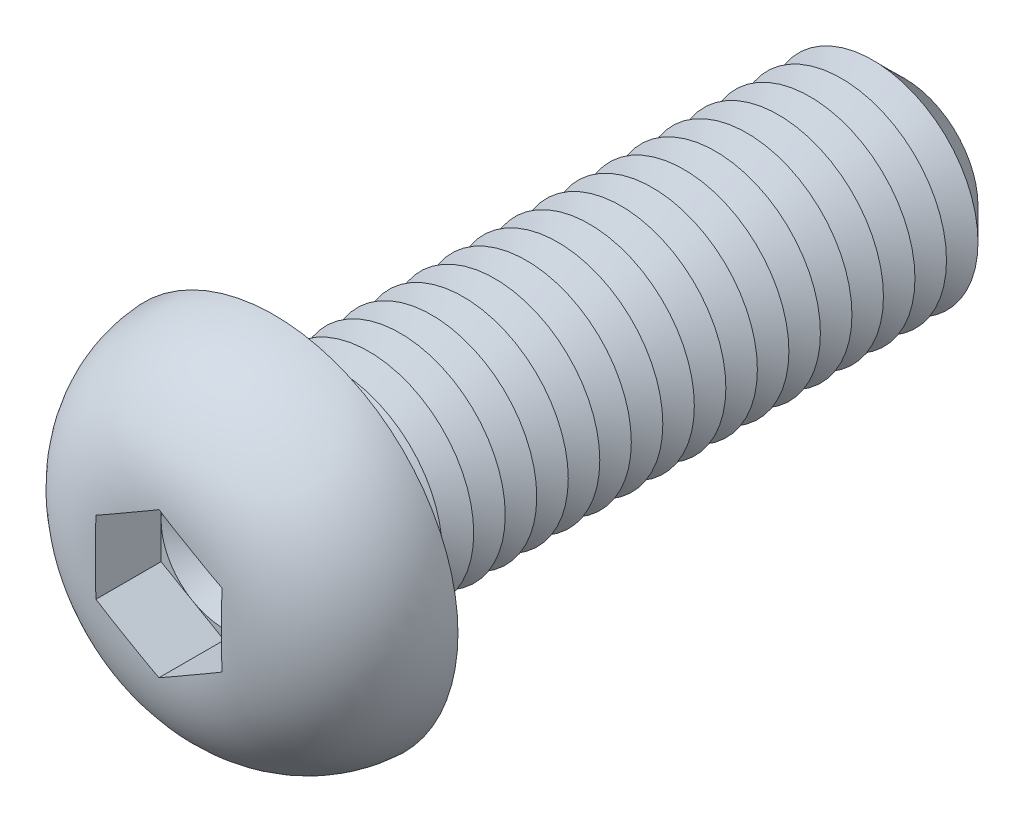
ISO-10303-21;
HEADER;
FILE_DESCRIPTION(('STEP AP214'),'2;1');
FILE_NAME('part.step','',(''),(''),'','','');
FILE_SCHEMA(('AUTOMOTIVE_DESIGN { 1 0 10303 214 1 1 1 1 }'));
ENDSEC;
DATA;
#1=APPLICATION_CONTEXT('core data for automotive mechanical design processes');
#2=APPLICATION_PROTOCOL_DEFINITION('international standard','automotive_design',2000,#1);
#3=PRODUCT_CONTEXT('',#1,'mechanical');
#4=PRODUCT('Part','Part','',(#3));
#5=PRODUCT_RELATED_PRODUCT_CATEGORY('part','',(#4));
#6=PRODUCT_DEFINITION_FORMATION('','',#4);
#7=PRODUCT_DEFINITION_CONTEXT('part definition',#1,'design');
#8=PRODUCT_DEFINITION('design','',#6,#7);
#9=PRODUCT_DEFINITION_SHAPE('','',#8);
#10=(LENGTH_UNIT() NAMED_UNIT(*) SI_UNIT(.MILLI.,.METRE.));
#11=(NAMED_UNIT(*) PLANE_ANGLE_UNIT() SI_UNIT($,.RADIAN.));
#12=(NAMED_UNIT(*) SI_UNIT($,.STERADIAN.) SOLID_ANGLE_UNIT());
#13=UNCERTAINTY_MEASURE_WITH_UNIT(LENGTH_MEASURE(1.E-05),#10,'distance_accuracy_value','');
#14=(GEOMETRIC_REPRESENTATION_CONTEXT(3) GLOBAL_UNCERTAINTY_ASSIGNED_CONTEXT((#13)) GLOBAL_UNIT_ASSIGNED_CONTEXT((#10,
#11,#12)) REPRESENTATION_CONTEXT('',''));
#15=CARTESIAN_POINT('',(0.,0.,0.));
#16=DIRECTION('',(0.,0.,1.));
#17=DIRECTION('',(1.,0.,0.));
#18=AXIS2_PLACEMENT_3D('',#15,#16,#17);
#19=CARTESIAN_POINT('',(0.,0.,2.38));
#20=DIRECTION('',(0.,0.,1.));
#21=DIRECTION('',(1.,0.,0.));
#22=AXIS2_PLACEMENT_3D('',#19,#20,#21);
#23=PLANE('',#22);
#24=CARTESIAN_POINT('',(0.,0.,2.38));
#25=DIRECTION('',(0.,0.,1.));
#26=DIRECTION('',(1.,0.,0.));
#27=AXIS2_PLACEMENT_3D('',#24,#25,#26);
#28=CIRCLE('',#27,3.);
#29=CARTESIAN_POINT('',(3.,0.,2.38));
#30=VERTEX_POINT('',#29);
#31=CARTESIAN_POINT('',(1.5,2.59807621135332,2.38));
#32=VERTEX_POINT('',#31);
#33=EDGE_CURVE('E117',#30,#32,#28,.T.);
#34=ORIENTED_EDGE('',*,*,#33,.F.);
#35=DIRECTION('',(0.,1.,0.));
#36=VECTOR('',#35,1.);
#37=CARTESIAN_POINT('',(3.,-1.73205080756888,2.38));
#38=LINE('',#37,#36);
#39=CARTESIAN_POINT('',(3.,1.73205080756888,2.38));
#40=VERTEX_POINT('',#39);
#41=EDGE_CURVE('E140',#30,#40,#38,.T.);
#42=ORIENTED_EDGE('',*,*,#41,.T.);
#43=DIRECTION('',(-0.866025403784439,0.5,0.));
#44=VECTOR('',#43,1.);
#45=CARTESIAN_POINT('',(3.,1.73205080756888,2.38));
#46=LINE('',#45,#44);
#47=EDGE_CURVE('E136',#40,#32,#46,.T.);
#48=ORIENTED_EDGE('',*,*,#47,.T.);
#49=EDGE_LOOP('',(#34,#42,#48));
#50=FACE_BOUND('',#49,.T.);
#51=ADVANCED_FACE('F39',(#50),#23,.T.);
#52=CARTESIAN_POINT('',(0.,0.,2.38));
#53=DIRECTION('',(0.,0.,1.));
#54=DIRECTION('',(1.,0.,0.));
#55=AXIS2_PLACEMENT_3D('',#52,#53,#54);
#56=CIRCLE('',#55,3.);
#57=CARTESIAN_POINT('',(-1.5,2.59807621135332,2.38));
#58=VERTEX_POINT('',#57);
#59=EDGE_CURVE('E11',#32,#58,#56,.T.);
#60=ORIENTED_EDGE('',*,*,#59,.F.);
#61=CARTESIAN_POINT('',(0.,3.46410161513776,2.38));
#62=VERTEX_POINT('',#61);
#63=EDGE_CURVE('E130',#32,#62,#46,.T.);
#64=ORIENTED_EDGE('',*,*,#63,.T.);
#65=DIRECTION('',(-0.866025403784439,-0.5,0.));
#66=VECTOR('',#65,1.);
#67=CARTESIAN_POINT('',(0.,3.46410161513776,2.38));
#68=LINE('',#67,#66);
#69=EDGE_CURVE('E131',#62,#58,#68,.T.);
#70=ORIENTED_EDGE('',*,*,#69,.T.);
#71=EDGE_LOOP('',(#60,#64,#70));
#72=FACE_BOUND('',#71,.T.);
#73=ADVANCED_FACE('F129',(#72),#23,.T.);
#74=CARTESIAN_POINT('',(-3.,0.,2.38));
#75=VERTEX_POINT('',#74);
#76=EDGE_CURVE('E49',#58,#75,#56,.T.);
#77=ORIENTED_EDGE('',*,*,#76,.F.);
#78=CARTESIAN_POINT('',(-3.,1.73205080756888,2.38));
#79=VERTEX_POINT('',#78);
#80=EDGE_CURVE('E143',#58,#79,#68,.T.);
#81=ORIENTED_EDGE('',*,*,#80,.T.);
#82=DIRECTION('',(0.,-1.,0.));
#83=VECTOR('',#82,1.);
#84=CARTESIAN_POINT('',(-3.,1.73205080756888,2.38));
#85=LINE('',#84,#83);
#86=EDGE_CURVE('E153',#79,#75,#85,.T.);
#87=ORIENTED_EDGE('',*,*,#86,.T.);
#88=EDGE_LOOP('',(#77,#81,#87));
#89=FACE_BOUND('',#88,.T.);
#90=ADVANCED_FACE('F270',(#89),#23,.T.);
#91=CARTESIAN_POINT('',(-1.5,-2.59807621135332,2.38));
#92=VERTEX_POINT('',#91);
#93=EDGE_CURVE('E254',#75,#92,#56,.T.);
#94=ORIENTED_EDGE('',*,*,#93,.F.);
#95=CARTESIAN_POINT('',(-3.,-1.73205080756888,2.38));
#96=VERTEX_POINT('',#95);
#97=EDGE_CURVE('E152',#75,#96,#85,.T.);
#98=ORIENTED_EDGE('',*,*,#97,.T.);
#99=DIRECTION('',(0.866025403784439,-0.5,0.));
#100=VECTOR('',#99,1.);
#101=CARTESIAN_POINT('',(-3.,-1.73205080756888,2.38));
#102=LINE('',#101,#100);
#103=EDGE_CURVE('E158',#96,#92,#102,.T.);
#104=ORIENTED_EDGE('',*,*,#103,.T.);
#105=EDGE_LOOP('',(#94,#98,#104));
#106=FACE_BOUND('',#105,.T.);
#107=ADVANCED_FACE('F264',(#106),#23,.T.);
#108=CARTESIAN_POINT('',(1.5,-2.59807621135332,2.38));
#109=VERTEX_POINT('',#108);
#110=EDGE_CURVE('E56',#92,#109,#56,.T.);
#111=ORIENTED_EDGE('',*,*,#110,.F.);
#112=CARTESIAN_POINT('',(0.,-3.46410161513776,2.38));
#113=VERTEX_POINT('',#112);
#114=EDGE_CURVE('E157',#92,#113,#102,.T.);
#115=ORIENTED_EDGE('',*,*,#114,.T.);
#116=DIRECTION('',(0.866025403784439,0.5,0.));
#117=VECTOR('',#116,1.);
#118=CARTESIAN_POINT('',(0.,-3.46410161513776,2.38));
#119=LINE('',#118,#117);
#120=EDGE_CURVE('E163',#113,#109,#119,.T.);
#121=ORIENTED_EDGE('',*,*,#120,.T.);
#122=EDGE_LOOP('',(#111,#115,#121));
#123=FACE_BOUND('',#122,.T.);
#124=ADVANCED_FACE('F307',(#123),#23,.T.);
#125=CARTESIAN_POINT('',(0.,0.,-30.));
#126=DIRECTION('',(0.,0.,1.));
#127=DIRECTION('',(1.,0.,0.));
#128=AXIS2_PLACEMENT_3D('',#125,#126,#127);
#129=CYLINDRICAL_SURFACE('',#128,5.);
#130=CARTESIAN_POINT('',(0.,0.,-0.6));
#131=DIRECTION('',(0.,0.,1.));
#132=DIRECTION('',(1.,0.,0.));
#133=AXIS2_PLACEMENT_3D('',#130,#131,#132);
#134=CIRCLE('',#133,5.);
#135=CARTESIAN_POINT('',(5.,0.,-0.6));
#136=VERTEX_POINT('',#135);
#137=EDGE_CURVE('E241',#136,#136,#134,.F.);
#138=ORIENTED_EDGE('',*,*,#137,.T.);
#139=EDGE_LOOP('',(#138));
#140=FACE_BOUND('',#139,.T.);
#141=CARTESIAN_POINT('',(0.,0.,-1.5));
#142=DIRECTION('',(0.,0.,1.));
#143=DIRECTION('',(1.,0.,0.));
#144=AXIS2_PLACEMENT_3D('',#141,#142,#143);
#145=CIRCLE('',#144,5.00000000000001);
#146=CARTESIAN_POINT('',(5.00000000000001,0.,-1.5));
#147=VERTEX_POINT('',#146);
#148=EDGE_CURVE('E138',#147,#147,#145,.T.);
#149=ORIENTED_EDGE('',*,*,#148,.T.);
#150=EDGE_LOOP('',(#149));
#151=FACE_BOUND('',#150,.T.);
#152=ADVANCED_FACE('F308',(#140,#151),#129,.T.);
#153=CARTESIAN_POINT('',(0.,8.75,0.));
#154=DIRECTION('',(0.,0.,1.));
#155=DIRECTION('',(1.,0.,0.));
#156=AXIS2_PLACEMENT_3D('',#153,#154,#155);
#157=PLANE('',#156);
#158=CARTESIAN_POINT('',(0.,0.,0.));
#159=DIRECTION('',(0.,0.,1.));
#160=DIRECTION('',(1.,0.,0.));
#161=AXIS2_PLACEMENT_3D('',#158,#159,#160);
#162=CIRCLE('',#161,5.6);
#163=CARTESIAN_POINT('',(5.6,0.,0.));
#164=VERTEX_POINT('',#163);
#165=EDGE_CURVE('E244',#164,#164,#162,.T.);
#166=ORIENTED_EDGE('',*,*,#165,.T.);
#167=EDGE_LOOP('',(#166));
#168=FACE_BOUND('',#167,.T.);
#169=CARTESIAN_POINT('',(0.,0.,0.));
#170=DIRECTION('',(0.,0.,1.));
#171=DIRECTION('',(1.,0.,0.));
#172=AXIS2_PLACEMENT_3D('',#169,#170,#171);
#173=CIRCLE('',#172,8.75);
#174=CARTESIAN_POINT('',(8.75,0.,0.));
#175=VERTEX_POINT('',#174);
#176=EDGE_CURVE('E174',#175,#175,#173,.T.);
#177=ORIENTED_EDGE('',*,*,#176,.F.);
#178=EDGE_LOOP('',(#177));
#179=FACE_BOUND('',#178,.T.);
#180=ADVANCED_FACE('F311',(#168,#179),#157,.F.);
#181=CARTESIAN_POINT('',(0.,0.,-0.3));
#182=DIRECTION('',(0.,0.,1.));
#183=DIRECTION('',(1.,0.,0.));
#184=AXIS2_PLACEMENT_3D('',#181,#182,#183);
#185=DEGENERATE_TOROIDAL_SURFACE('',#184,2.95776381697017,5.8,.T.);
#186=CARTESIAN_POINT('',(-3.0002,1.73193533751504,5.47784605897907));
#187=CARTESIAN_POINT('',(-2.87524340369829,1.80407906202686,5.4841525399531));
#188=CARTESIAN_POINT('',(-2.75023731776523,1.87625135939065,5.48853670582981));
#189=CARTESIAN_POINT('',(-2.5001955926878,2.02061301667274,5.49472046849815));
#190=CARTESIAN_POINT('',(-2.37515996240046,2.09280237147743,5.49652051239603));
#191=CARTESIAN_POINT('',(-2.12510741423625,2.23717027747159,5.4987972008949));
#192=CARTESIAN_POINT('',(-2.00009049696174,2.30934882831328,5.49927407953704));
#193=CARTESIAN_POINT('',(-1.75004905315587,2.45371032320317,5.49979859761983));
#194=CARTESIAN_POINT('',(-1.62502452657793,2.52589326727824,5.49984621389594));
#195=CARTESIAN_POINT('',(-1.37497547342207,2.67025915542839,5.49984621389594));
#196=CARTESIAN_POINT('',(-1.24995094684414,2.74244209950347,5.49979859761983));
#197=CARTESIAN_POINT('',(-0.999909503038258,2.88680359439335,5.49927407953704));
#198=CARTESIAN_POINT('',(-0.874892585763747,2.95898214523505,5.4987972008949));
#199=CARTESIAN_POINT('',(-0.624840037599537,3.10335005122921,5.49652051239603));
#200=CARTESIAN_POINT('',(-0.499804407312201,3.1755394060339,5.49472046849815));
#201=CARTESIAN_POINT('',(-0.249762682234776,3.31990106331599,5.48853670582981));
#202=CARTESIAN_POINT('',(-0.124756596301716,3.39207336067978,5.4841525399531));
#203=CARTESIAN_POINT('',(0.000199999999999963,3.46421708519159,5.47784605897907));
#204=B_SPLINE_CURVE_WITH_KNOTS('',3,(#186,#187,#188,#189,#190,#191,#192,#193,#194,#195,#196,
#197,#198,#199,#200,#201,#202,#203),.UNSPECIFIED.,.F.,.F.,(4,2,2,2,2,2,2,2,4),(0.,
0.433225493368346,0.866376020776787,1.29944992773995,1.73254720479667,2.16564448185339,
2.59871838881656,3.031868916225,3.46509440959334),.UNSPECIFIED.);
#205=CARTESIAN_POINT('',(-3.,1.73205080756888,5.4778561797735));
#206=VERTEX_POINT('',#205);
#207=CARTESIAN_POINT('',(0.,3.46410161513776,5.4778561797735));
#208=VERTEX_POINT('',#207);
#209=EDGE_CURVE('E196',#206,#208,#204,.T.);
#210=ORIENTED_EDGE('',*,*,#209,.T.);
#211=CARTESIAN_POINT('',(-0.000200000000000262,3.46421708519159,5.47784605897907));
#212=CARTESIAN_POINT('',(0.124756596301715,3.39207336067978,5.4841525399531));
#213=CARTESIAN_POINT('',(0.249762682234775,3.31990106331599,5.48853670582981));
#214=CARTESIAN_POINT('',(0.4998044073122,3.1755394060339,5.49472046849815));
#215=CARTESIAN_POINT('',(0.624840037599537,3.10335005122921,5.49652051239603));
#216=CARTESIAN_POINT('',(0.874892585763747,2.95898214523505,5.4987972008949));
#217=CARTESIAN_POINT('',(0.999909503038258,2.88680359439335,5.49927407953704));
#218=CARTESIAN_POINT('',(1.24995094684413,2.74244209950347,5.49979859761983));
#219=CARTESIAN_POINT('',(1.37497547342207,2.67025915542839,5.49984621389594));
#220=CARTESIAN_POINT('',(1.62502452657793,2.52589326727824,5.49984621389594));
#221=CARTESIAN_POINT('',(1.75004905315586,2.45371032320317,5.49979859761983));
#222=CARTESIAN_POINT('',(2.00009049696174,2.30934882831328,5.49927407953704));
#223=CARTESIAN_POINT('',(2.12510741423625,2.23717027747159,5.4987972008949));
#224=CARTESIAN_POINT('',(2.37515996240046,2.09280237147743,5.49652051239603));
#225=CARTESIAN_POINT('',(2.5001955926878,2.02061301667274,5.49472046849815));
#226=CARTESIAN_POINT('',(2.75023731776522,1.87625135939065,5.48853670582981));
#227=CARTESIAN_POINT('',(2.87524340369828,1.80407906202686,5.4841525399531));
#228=CARTESIAN_POINT('',(3.0002,1.73193533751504,5.47784605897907));
#229=B_SPLINE_CURVE_WITH_KNOTS('',3,(#211,#212,#213,#214,#215,#216,#217,#218,#219,#220,#221,
#222,#223,#224,#225,#226,#227,#228),.UNSPECIFIED.,.F.,.F.,(4,2,2,2,2,2,2,2,4),(0.,
0.433225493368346,0.866376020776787,1.29944992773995,1.73254720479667,2.16564448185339,
2.59871838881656,3.031868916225,3.46509440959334),.UNSPECIFIED.);
#230=CARTESIAN_POINT('',(3.,1.73205080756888,5.47785617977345));
#231=VERTEX_POINT('',#230);
#232=EDGE_CURVE('E225',#208,#231,#229,.T.);
#233=ORIENTED_EDGE('',*,*,#232,.T.);
#234=CARTESIAN_POINT('',(3.,0.,5.49984621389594));
#235=CARTESIAN_POINT('',(3.,-0.125570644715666,5.49984449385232));
#236=CARTESIAN_POINT('',(3.,-0.251141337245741,5.49980426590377));
#237=CARTESIAN_POINT('',(3.,-0.502283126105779,5.499449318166));
#238=CARTESIAN_POINT('',(3.,-0.62785422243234,5.49913459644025));
#239=CARTESIAN_POINT('',(3.,-0.879037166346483,5.49770394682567));
#240=CARTESIAN_POINT('',(3.,-1.00464901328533,5.49658774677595));
#241=CARTESIAN_POINT('',(3.,-1.2558477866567,5.49279605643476));
#242=CARTESIAN_POINT('',(3.,-1.38143471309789,5.49012056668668));
#243=CARTESIAN_POINT('',(3.,-1.7568847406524,5.47847778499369));
#244=CARTESIAN_POINT('',(3.,-2.00667103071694,5.46590367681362));
#245=CARTESIAN_POINT('',(3.,-2.50488375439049,5.42441448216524));
#246=CARTESIAN_POINT('',(3.,-2.75331093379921,5.3955095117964));
#247=CARTESIAN_POINT('',(3.,-3.18719021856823,5.32582626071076));
#248=CARTESIAN_POINT('',(3.,-3.3733635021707,5.28960049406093));
#249=CARTESIAN_POINT('',(3.,-3.74245496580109,5.20330651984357));
#250=CARTESIAN_POINT('',(3.,-3.92537417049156,5.15324275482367));
#251=CARTESIAN_POINT('',(3.,-4.28675502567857,5.03819885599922));
#252=CARTESIAN_POINT('',(3.,-4.46521058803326,4.97319946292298));
#253=CARTESIAN_POINT('',(3.,-4.81576789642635,4.82782766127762));
#254=CARTESIAN_POINT('',(3.,-4.98786985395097,4.74745576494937));
#255=CARTESIAN_POINT('',(3.,-5.3254008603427,4.5705398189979));
#256=CARTESIAN_POINT('',(3.,-5.49076268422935,4.47386710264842));
#257=CARTESIAN_POINT('',(3.,-5.81151175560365,4.26514040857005));
#258=CARTESIAN_POINT('',(3.,-5.96689840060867,4.15308550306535));
#259=CARTESIAN_POINT('',(3.,-6.26591787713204,3.91428862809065));
#260=CARTESIAN_POINT('',(3.,-6.40955257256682,3.78754899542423));
#261=CARTESIAN_POINT('',(3.,-6.68342295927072,3.52034797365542));
#262=CARTESIAN_POINT('',(3.,-6.81366070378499,3.3798886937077));
#263=CARTESIAN_POINT('',(3.,-7.0426666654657,3.10626157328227));
#264=CARTESIAN_POINT('',(3.,-7.1433109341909,2.97465879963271));
#265=CARTESIAN_POINT('',(3.,-7.33253056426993,2.70304716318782));
#266=CARTESIAN_POINT('',(3.,-7.42110686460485,2.56303895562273));
#267=CARTESIAN_POINT('',(3.,-7.58534868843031,2.27573732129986));
#268=CARTESIAN_POINT('',(3.,-7.66102067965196,2.12844759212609));
#269=CARTESIAN_POINT('',(3.,-7.79881901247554,1.82765987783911));
#270=CARTESIAN_POINT('',(3.,-7.86094563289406,1.67416202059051));
#271=CARTESIAN_POINT('',(3.,-7.96803488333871,1.37082076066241));
#272=CARTESIAN_POINT('',(3.,-8.01375687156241,1.22124490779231));
#273=CARTESIAN_POINT('',(3.,-8.09224398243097,0.918674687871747));
#274=CARTESIAN_POINT('',(3.,-8.12500479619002,0.765679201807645));
#275=CARTESIAN_POINT('',(3.,-8.17726457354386,0.457507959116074));
#276=CARTESIAN_POINT('',(3.,-8.1967692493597,0.302333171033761));
#277=CARTESIAN_POINT('',(3.,-8.22238322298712,-0.00917738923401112));
#278=CARTESIAN_POINT('',(3.,-8.22848754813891,-0.165513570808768));
#279=CARTESIAN_POINT('',(3.,-8.22724693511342,-0.475358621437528));
#280=CARTESIAN_POINT('',(3.,-8.2201384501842,-0.628868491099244));
#281=CARTESIAN_POINT('',(3.,-8.1929851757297,-0.934809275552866));
#282=CARTESIAN_POINT('',(3.,-8.17293462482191,-1.0872396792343));
#283=CARTESIAN_POINT('',(3.,-8.1200547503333,-1.38984943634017));
#284=CARTESIAN_POINT('',(3.,-8.08722683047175,-1.54002903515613));
#285=CARTESIAN_POINT('',(3.,-8.0090712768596,-1.83702738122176));
#286=CARTESIAN_POINT('',(3.,-7.96374919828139,-1.98384759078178));
#287=CARTESIAN_POINT('',(3.,-7.86096457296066,-2.27315566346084));
#288=CARTESIAN_POINT('',(3.,-7.80350334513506,-2.41564399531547));
#289=CARTESIAN_POINT('',(3.,-7.67691451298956,-2.6952770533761));
#290=CARTESIAN_POINT('',(3.,-7.60779108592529,-2.83242367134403));
#291=CARTESIAN_POINT('',(3.,-7.45837210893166,-3.10056990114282));
#292=CARTESIAN_POINT('',(3.,-7.37807144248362,-3.23156666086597));
#293=CARTESIAN_POINT('',(3.,-7.20697634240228,-3.48645411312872));
#294=CARTESIAN_POINT('',(3.,-7.11618520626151,-3.61034702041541));
#295=CARTESIAN_POINT('',(3.,-6.92334779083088,-3.85210954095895));
#296=CARTESIAN_POINT('',(3.,-6.82115263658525,-3.96986038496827));
#297=CARTESIAN_POINT('',(3.,-6.60745266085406,-4.19658717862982));
#298=CARTESIAN_POINT('',(3.,-6.49594754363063,-4.30556284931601));
#299=CARTESIAN_POINT('',(3.,-6.26450055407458,-4.51413072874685));
#300=CARTESIAN_POINT('',(3.,-6.14455919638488,-4.61372350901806));
#301=CARTESIAN_POINT('',(3.,-5.8971402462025,-4.80306090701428));
#302=CARTESIAN_POINT('',(3.,-5.76966228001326,-4.89280503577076));
#303=CARTESIAN_POINT('',(3.,-5.50268934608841,-5.06561354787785));
#304=CARTESIAN_POINT('',(3.,-5.36291526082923,-5.14824654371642));
#305=CARTESIAN_POINT('',(3.,-5.07726499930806,-5.30226841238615));
#306=CARTESIAN_POINT('',(3.,-4.93138704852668,-5.37365398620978));
#307=CARTESIAN_POINT('',(3.,-4.63484455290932,-5.50505544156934));
#308=CARTESIAN_POINT('',(3.,-4.48418671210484,-5.56508649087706));
#309=CARTESIAN_POINT('',(3.,-4.17906596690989,-5.6740700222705));
#310=CARTESIAN_POINT('',(3.,-4.02460600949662,-5.72303080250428));
#311=CARTESIAN_POINT('',(3.,-3.6739247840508,-5.82125760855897));
#312=CARTESIAN_POINT('',(3.,-3.47687521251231,-5.86756841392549));
#313=CARTESIAN_POINT('',(3.,-3.07981530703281,-5.94521593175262));
#314=CARTESIAN_POINT('',(3.,-2.87980357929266,-5.97654534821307));
#315=CARTESIAN_POINT('',(3.,-2.47751859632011,-6.02656554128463));
#316=CARTESIAN_POINT('',(3.,-2.27523974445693,-6.0452096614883));
#317=CARTESIAN_POINT('',(3.,-1.8700786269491,-6.07274849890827));
#318=CARTESIAN_POINT('',(3.,-1.66719636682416,-6.08164330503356));
#319=CARTESIAN_POINT('',(3.,-1.25887867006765,-6.09343726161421));
#320=CARTESIAN_POINT('',(3.,-1.05344157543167,-6.09626381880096));
#321=CARTESIAN_POINT('',(3.,-0.745285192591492,-6.0985660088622));
#322=CARTESIAN_POINT('',(3.,-0.642567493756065,-6.09901047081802));
#323=CARTESIAN_POINT('',(3.,-0.437131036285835,-6.09957976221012));
#324=CARTESIAN_POINT('',(3.,-0.334412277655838,-6.09970459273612));
#325=CARTESIAN_POINT('',(3.,-0.129132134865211,-6.09984385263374));
#326=CARTESIAN_POINT('',(3.,-0.0265707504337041,-6.09985845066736));
#327=CARTESIAN_POINT('',(3.,0.178552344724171,-6.09981980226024));
#328=CARTESIAN_POINT('',(3.,0.281114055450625,-6.09976655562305));
#329=CARTESIAN_POINT('',(3.,0.486235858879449,-6.09946703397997));
#330=CARTESIAN_POINT('',(3.,0.588795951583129,-6.0992207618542));
#331=CARTESIAN_POINT('',(3.,0.793913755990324,-6.09826017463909));
#332=CARTESIAN_POINT('',(3.,0.896471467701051,-6.097545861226));
#333=CARTESIAN_POINT('',(3.,1.11088851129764,-6.0951586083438));
#334=CARTESIAN_POINT('',(3.,1.22274716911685,-6.0934045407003));
#335=CARTESIAN_POINT('',(3.,1.44642575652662,-6.08829151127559));
#336=CARTESIAN_POINT('',(3.,1.55824568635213,-6.08493255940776));
#337=CARTESIAN_POINT('',(3.,1.89360474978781,-6.07150074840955));
#338=CARTESIAN_POINT('',(3.,2.11703989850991,-6.05807293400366));
#339=CARTESIAN_POINT('',(3.,2.56083256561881,-6.01778675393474));
#340=CARTESIAN_POINT('',(3.,2.78120000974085,-5.99104517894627));
#341=CARTESIAN_POINT('',(3.,3.2192866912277,-5.92065658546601));
#342=CARTESIAN_POINT('',(3.,3.43700630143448,-5.8770119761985));
#343=CARTESIAN_POINT('',(3.,3.82666678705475,-5.78060449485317));
#344=CARTESIAN_POINT('',(3.,3.99942726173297,-5.73116262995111));
#345=CARTESIAN_POINT('',(3.,4.3405567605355,-5.61888897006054));
#346=CARTESIAN_POINT('',(3.,4.50892617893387,-5.55605838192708));
#347=CARTESIAN_POINT('',(3.,4.84049143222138,-5.41635874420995));
#348=CARTESIAN_POINT('',(3.,5.00366586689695,-5.33943871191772));
#349=CARTESIAN_POINT('',(3.,5.32271829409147,-5.17167128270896));
#350=CARTESIAN_POINT('',(3.,5.47859600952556,-5.0808233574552));
#351=CARTESIAN_POINT('',(3.,5.7822829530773,-4.88500135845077));
#352=CARTESIAN_POINT('',(3.,5.93005015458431,-4.77996197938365));
#353=CARTESIAN_POINT('',(3.,6.21523046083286,-4.55663689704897));
#354=CARTESIAN_POINT('',(3.,6.35264336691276,-4.43835093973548));
#355=CARTESIAN_POINT('',(3.,6.61552762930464,-4.18948618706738));
#356=CARTESIAN_POINT('',(3.,6.74101380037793,-4.05892305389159));
#357=CARTESIAN_POINT('',(3.,6.97891308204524,-3.78639059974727));
#358=CARTESIAN_POINT('',(3.,7.09132750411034,-3.64442242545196));
#359=CARTESIAN_POINT('',(3.,7.29113623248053,-3.36530209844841));
#360=CARTESIAN_POINT('',(3.,7.37991316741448,-3.22913733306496));
#361=CARTESIAN_POINT('',(3.,7.5451968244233,-2.94955428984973));
#362=CARTESIAN_POINT('',(3.,7.62170419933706,-2.80613639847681));
#363=CARTESIAN_POINT('',(3.,7.76177641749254,-2.5131168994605));
#364=CARTESIAN_POINT('',(3.,7.82534152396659,-2.36351541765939));
#365=CARTESIAN_POINT('',(3.,7.93897019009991,-2.05926799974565));
#366=CARTESIAN_POINT('',(3.,7.98903395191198,-1.9046221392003));
#367=CARTESIAN_POINT('',(3.,8.07336540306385,-1.59821781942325));
#368=CARTESIAN_POINT('',(3.,8.10821878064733,-1.44662026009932));
#369=CARTESIAN_POINT('',(3.,8.16487862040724,-1.14095089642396));
#370=CARTESIAN_POINT('',(3.,8.18668070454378,-0.986878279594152));
#371=CARTESIAN_POINT('',(3.,8.21703234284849,-0.677515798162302));
#372=CARTESIAN_POINT('',(3.,8.22558889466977,-0.522226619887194));
#373=CARTESIAN_POINT('',(3.,8.22940229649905,-0.211427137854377));
#374=CARTESIAN_POINT('',(3.,8.22465425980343,-0.0559167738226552));
#375=CARTESIAN_POINT('',(3.,8.20204101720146,0.252033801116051));
#376=CARTESIAN_POINT('',(3.,8.18435378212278,0.404487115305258));
#377=CARTESIAN_POINT('',(3.,8.136196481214,0.707418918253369));
#378=CARTESIAN_POINT('',(3.,8.1057217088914,0.857896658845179));
#379=CARTESIAN_POINT('',(3.,8.03224632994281,1.15569567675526));
#380=CARTESIAN_POINT('',(3.,7.9892508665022,1.30301822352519));
#381=CARTESIAN_POINT('',(3.,7.89104818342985,1.59360769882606));
#382=CARTESIAN_POINT('',(3.,7.83583549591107,1.73687277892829));
#383=CARTESIAN_POINT('',(3.,7.71349498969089,2.01864020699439));
#384=CARTESIAN_POINT('',(3.,7.64633814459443,2.1571299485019));
#385=CARTESIAN_POINT('',(3.,7.50076383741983,2.42797950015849));
#386=CARTESIAN_POINT('',(3.,7.42235122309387,2.56034191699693));
#387=CARTESIAN_POINT('',(3.,7.25483284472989,2.8181715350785));
#388=CARTESIAN_POINT('',(3.,7.16572386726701,2.94363664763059));
#389=CARTESIAN_POINT('',(3.,6.9775559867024,3.1867979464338));
#390=CARTESIAN_POINT('',(3.,6.87850037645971,3.30449668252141));
#391=CARTESIAN_POINT('',(3.,6.66919743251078,3.53363644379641));
#392=CARTESIAN_POINT('',(3.,6.55877281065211,3.6449154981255));
#393=CARTESIAN_POINT('',(3.,6.32925753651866,3.85806320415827));
#394=CARTESIAN_POINT('',(3.,6.21016952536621,3.95993470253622));
#395=CARTESIAN_POINT('',(3.,5.96413069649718,4.15386505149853));
#396=CARTESIAN_POINT('',(3.,5.83717459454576,4.24591719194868));
#397=CARTESIAN_POINT('',(3.,5.5764653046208,4.41973423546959));
#398=CARTESIAN_POINT('',(3.,5.4427139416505,4.50150188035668));
#399=CARTESIAN_POINT('',(3.,5.16249709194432,4.65840017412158));
#400=CARTESIAN_POINT('',(3.,5.01573037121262,4.73299250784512));
#401=CARTESIAN_POINT('',(3.,4.71685583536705,4.87057528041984));
#402=CARTESIAN_POINT('',(3.,4.56474751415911,4.93356461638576));
#403=CARTESIAN_POINT('',(3.,4.25657035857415,5.04801407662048));
#404=CARTESIAN_POINT('',(3.,4.10050882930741,5.09949395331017));
#405=CARTESIAN_POINT('',(3.,3.78523286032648,5.19149003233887));
#406=CARTESIAN_POINT('',(3.,3.62601895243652,5.23200806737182));
#407=CARTESIAN_POINT('',(3.,3.32461902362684,5.29856444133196));
#408=CARTESIAN_POINT('',(3.,3.18268434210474,5.32575733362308));
#409=CARTESIAN_POINT('',(3.,2.89760844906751,5.3729307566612));
#410=CARTESIAN_POINT('',(3.,2.75446703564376,5.39291005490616));
#411=CARTESIAN_POINT('',(3.,2.46730946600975,5.42656527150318));
#412=CARTESIAN_POINT('',(3.,2.32329255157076,5.44023457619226));
#413=CARTESIAN_POINT('',(3.,2.03487642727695,5.46234228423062));
#414=CARTESIAN_POINT('',(3.,1.89047722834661,5.4707808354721));
#415=CARTESIAN_POINT('',(3.,1.60058090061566,5.48373897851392));
#416=CARTESIAN_POINT('',(3.,1.45508270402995,5.48823290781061));
#417=CARTESIAN_POINT('',(3.,1.16402671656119,5.49458098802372));
#418=CARTESIAN_POINT('',(3.,1.01846892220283,5.49643495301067));
#419=CARTESIAN_POINT('',(3.,0.72742451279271,5.49877506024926));
#420=CARTESIAN_POINT('',(3.,0.581937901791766,5.49926194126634));
#421=CARTESIAN_POINT('',(3.,0.290967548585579,5.49979850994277));
#422=CARTESIAN_POINT('',(3.,0.145483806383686,5.49984820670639));
#423=CARTESIAN_POINT('',(3.,0.,5.49984621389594));
#424=B_SPLINE_CURVE_WITH_KNOTS('',3,(#234,#235,#236,#237,#238,#239,#240,#241,#242,#243,#244,
#245,#246,#247,#248,#249,#250,#251,#252,#253,#254,#255,#256,#257,#258,#259,#260,#261,#262,#263,
#264,#265,#266,#267,#268,#269,#270,#271,#272,#273,#274,#275,#276,#277,#278,#279,#280,#281,#282,
#283,#284,#285,#286,#287,#288,#289,#290,#291,#292,#293,#294,#295,#296,#297,#298,#299,#300,#301,
#302,#303,#304,#305,#306,#307,#308,#309,#310,#311,#312,#313,#314,#315,#316,#317,#318,#319,#320,
#321,#322,#323,#324,#325,#326,#327,#328,#329,#330,#331,#332,#333,#334,#335,#336,#337,#338,#339,
#340,#341,#342,#343,#344,#345,#346,#347,#348,#349,#350,#351,#352,#353,#354,#355,#356,#357,#358,
#359,#360,#361,#362,#363,#364,#365,#366,#367,#368,#369,#370,#371,#372,#373,#374,#375,#376,#377,
#378,#379,#380,#381,#382,#383,#384,#385,#386,#387,#388,#389,#390,#391,#392,#393,#394,#395,#396,
#397,#398,#399,#400,#401,#402,#403,#404,#405,#406,#407,#408,#409,#410,#411,#412,#413,#414,#415,
#416,#417,#418,#419,#420,#421,#422,#423),.UNSPECIFIED.,.T.,.F.,(4,2,2,2,2,2,2,2,2,2,2,2,2,2,2,2,
2,2,2,2,2,2,2,2,2,2,2,2,2,2,2,2,2,2,2,2,2,2,2,2,2,2,2,2,2,2,2,2,2,2,2,2,2,2,2,2,2,2,2,2,2,2,2,2,
2,2,2,2,2,2,2,2,2,2,2,2,2,2,2,2,2,2,2,2,2,2,2,2,2,2,2,2,2,2,4),(0.,0.376711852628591,
0.753426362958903,1.13026885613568,1.50711121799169,2.257095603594,3.00661592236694,
3.57514719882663,4.14349616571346,4.71258216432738,5.28164920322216,5.85543852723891,
6.42926247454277,7.00299523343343,7.57663992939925,8.07303876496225,8.56939895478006,
9.06550962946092,9.56161009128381,10.030267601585,10.4990807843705,10.9676918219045,
11.4364767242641,11.8969530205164,12.3576344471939,12.8182652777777,13.2786916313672,
13.7390679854,14.1992797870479,14.6597029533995,15.1199817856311,15.5871904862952,
16.0544140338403,16.5216091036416,16.9888273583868,17.4754224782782,17.9621600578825,
18.4482427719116,18.9339599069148,19.5405320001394,20.1473991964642,20.7564865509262,
21.3655683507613,21.9818967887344,22.2900536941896,22.5982095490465,22.905893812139,
23.2135789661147,23.5212595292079,23.8289389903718,24.1645461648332,24.5001512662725,
25.171371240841,25.8368042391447,26.5021424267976,27.0407309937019,27.5792710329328,
28.119799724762,28.660348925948,29.2034761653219,29.7466138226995,30.2890677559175,
30.831467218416,31.3185063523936,31.8055195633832,32.2925228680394,32.779518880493,
33.2456153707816,33.7118681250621,34.1778744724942,34.6440520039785,35.103935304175,
35.563988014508,36.0238520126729,36.4839222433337,36.9451261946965,37.4061321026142,
37.8672768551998,38.3282694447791,38.7980460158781,39.2676799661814,39.7376328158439,
40.207460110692,40.7008436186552,41.1942739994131,41.6868509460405,42.1793454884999,
42.6126940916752,43.0461167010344,43.479992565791,43.9138561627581,44.3505218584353,
44.7872183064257,45.2236787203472,45.6601300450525),.UNSPECIFIED.);
#425=CARTESIAN_POINT('',(3.,-1.73205080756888,5.4778561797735));
#426=VERTEX_POINT('',#425);
#427=EDGE_CURVE('E233',#231,#426,#424,.T.);
#428=ORIENTED_EDGE('',*,*,#427,.T.);
#429=CARTESIAN_POINT('',(3.0002,-1.73193533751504,5.47784605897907));
#430=CARTESIAN_POINT('',(2.87524340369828,-1.80407906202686,5.4841525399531));
#431=CARTESIAN_POINT('',(2.75023731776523,-1.87625135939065,5.48853670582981));
#432=CARTESIAN_POINT('',(2.5001955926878,-2.02061301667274,5.49472046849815));
#433=CARTESIAN_POINT('',(2.37515996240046,-2.09280237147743,5.49652051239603));
#434=CARTESIAN_POINT('',(2.12510741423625,-2.23717027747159,5.4987972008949));
#435=CARTESIAN_POINT('',(2.00009049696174,-2.30934882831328,5.49927407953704));
#436=CARTESIAN_POINT('',(1.75004905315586,-2.45371032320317,5.49979859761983));
#437=CARTESIAN_POINT('',(1.62502452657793,-2.52589326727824,5.49984621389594));
#438=CARTESIAN_POINT('',(1.37497547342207,-2.67025915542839,5.49984621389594));
#439=CARTESIAN_POINT('',(1.24995094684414,-2.74244209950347,5.49979859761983));
#440=CARTESIAN_POINT('',(0.999909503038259,-2.88680359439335,5.49927407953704));
#441=CARTESIAN_POINT('',(0.874892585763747,-2.95898214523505,5.4987972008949));
#442=CARTESIAN_POINT('',(0.624840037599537,-3.10335005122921,5.49652051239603));
#443=CARTESIAN_POINT('',(0.499804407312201,-3.1755394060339,5.49472046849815));
#444=CARTESIAN_POINT('',(0.249762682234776,-3.31990106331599,5.48853670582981));
#445=CARTESIAN_POINT('',(0.124756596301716,-3.39207336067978,5.4841525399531));
#446=CARTESIAN_POINT('',(-0.000199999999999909,-3.46421708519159,5.47784605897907));
#447=B_SPLINE_CURVE_WITH_KNOTS('',3,(#429,#430,#431,#432,#433,#434,#435,#436,#437,#438,#439,
#440,#441,#442,#443,#444,#445,#446),.UNSPECIFIED.,.F.,.F.,(4,2,2,2,2,2,2,2,4),(0.,
0.433225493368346,0.866376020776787,1.29944992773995,1.73254720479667,2.16564448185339,
2.59871838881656,3.031868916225,3.46509440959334),.UNSPECIFIED.);
#448=CARTESIAN_POINT('',(0.,-3.46410161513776,5.4778561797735));
#449=VERTEX_POINT('',#448);
#450=EDGE_CURVE('E281',#426,#449,#447,.T.);
#451=ORIENTED_EDGE('',*,*,#450,.T.);
#452=CARTESIAN_POINT('',(0.000200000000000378,-3.46421708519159,5.47784605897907));
#453=CARTESIAN_POINT('',(-0.124756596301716,-3.39207336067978,5.4841525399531));
#454=CARTESIAN_POINT('',(-0.249762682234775,-3.31990106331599,5.48853670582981));
#455=CARTESIAN_POINT('',(-0.499804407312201,-3.1755394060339,5.49472046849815));
#456=CARTESIAN_POINT('',(-0.624840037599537,-3.10335005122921,5.49652051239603));
#457=CARTESIAN_POINT('',(-0.874892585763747,-2.95898214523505,5.4987972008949));
#458=CARTESIAN_POINT('',(-0.999909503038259,-2.88680359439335,5.49927407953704));
#459=CARTESIAN_POINT('',(-1.24995094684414,-2.74244209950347,5.49979859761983));
#460=CARTESIAN_POINT('',(-1.37497547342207,-2.67025915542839,5.49984621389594));
#461=CARTESIAN_POINT('',(-1.62502452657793,-2.52589326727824,5.49984621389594));
#462=CARTESIAN_POINT('',(-1.75004905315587,-2.45371032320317,5.49979859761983));
#463=CARTESIAN_POINT('',(-2.00009049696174,-2.30934882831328,5.49927407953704));
#464=CARTESIAN_POINT('',(-2.12510741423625,-2.23717027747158,5.4987972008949));
#465=CARTESIAN_POINT('',(-2.37515996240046,-2.09280237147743,5.49652051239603));
#466=CARTESIAN_POINT('',(-2.5001955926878,-2.02061301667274,5.49472046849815));
#467=CARTESIAN_POINT('',(-2.75023731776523,-1.87625135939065,5.48853670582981));
#468=CARTESIAN_POINT('',(-2.87524340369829,-1.80407906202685,5.4841525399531));
#469=CARTESIAN_POINT('',(-3.0002,-1.73193533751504,5.47784605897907));
#470=B_SPLINE_CURVE_WITH_KNOTS('',3,(#452,#453,#454,#455,#456,#457,#458,#459,#460,#461,#462,
#463,#464,#465,#466,#467,#468,#469),.UNSPECIFIED.,.F.,.F.,(4,2,2,2,2,2,2,2,4),(0.,
0.433225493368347,0.866376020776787,1.29944992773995,1.73254720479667,2.16564448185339,
2.59871838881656,3.031868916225,3.46509440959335),.UNSPECIFIED.);
#471=CARTESIAN_POINT('',(-3.,-1.73205080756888,5.47785617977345));
#472=VERTEX_POINT('',#471);
#473=EDGE_CURVE('E277',#449,#472,#470,.T.);
#474=ORIENTED_EDGE('',*,*,#473,.T.);
#475=CARTESIAN_POINT('',(-3.,0.,5.49984621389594));
#476=CARTESIAN_POINT('',(-3.,0.125570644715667,5.49984449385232));
#477=CARTESIAN_POINT('',(-3.,0.251141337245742,5.49980426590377));
#478=CARTESIAN_POINT('',(-3.,0.50228312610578,5.499449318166));
#479=CARTESIAN_POINT('',(-3.,0.627854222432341,5.49913459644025));
#480=CARTESIAN_POINT('',(-3.,0.879037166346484,5.49770394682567));
#481=CARTESIAN_POINT('',(-3.,1.00464901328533,5.49658774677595));
#482=CARTESIAN_POINT('',(-3.,1.2558477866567,5.49279605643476));
#483=CARTESIAN_POINT('',(-3.,1.3814347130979,5.49012056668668));
#484=CARTESIAN_POINT('',(-3.,1.7568847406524,5.47847778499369));
#485=CARTESIAN_POINT('',(-3.,2.00667103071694,5.46590367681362));
#486=CARTESIAN_POINT('',(-3.,2.50488375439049,5.42441448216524));
#487=CARTESIAN_POINT('',(-3.,2.75331093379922,5.3955095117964));
#488=CARTESIAN_POINT('',(-3.,3.18719021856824,5.32582626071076));
#489=CARTESIAN_POINT('',(-3.,3.3733635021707,5.28960049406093));
#490=CARTESIAN_POINT('',(-3.,3.74245496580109,5.20330651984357));
#491=CARTESIAN_POINT('',(-3.,3.92537417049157,5.15324275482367));
#492=CARTESIAN_POINT('',(-3.,4.28675502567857,5.03819885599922));
#493=CARTESIAN_POINT('',(-3.,4.46521058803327,4.97319946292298));
#494=CARTESIAN_POINT('',(-3.,4.81576789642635,4.82782766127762));
#495=CARTESIAN_POINT('',(-3.,4.98786985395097,4.74745576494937));
#496=CARTESIAN_POINT('',(-3.,5.3254008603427,4.5705398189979));
#497=CARTESIAN_POINT('',(-3.,5.49076268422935,4.47386710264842));
#498=CARTESIAN_POINT('',(-3.,5.81151175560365,4.26514040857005));
#499=CARTESIAN_POINT('',(-3.,5.96689840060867,4.15308550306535));
#500=CARTESIAN_POINT('',(-3.,6.26591787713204,3.91428862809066));
#501=CARTESIAN_POINT('',(-3.,6.40955257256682,3.78754899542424));
#502=CARTESIAN_POINT('',(-3.,6.68342295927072,3.52034797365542));
#503=CARTESIAN_POINT('',(-3.,6.81366070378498,3.3798886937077));
#504=CARTESIAN_POINT('',(-3.,7.0426666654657,3.10626157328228));
#505=CARTESIAN_POINT('',(-3.,7.14331093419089,2.97465879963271));
#506=CARTESIAN_POINT('',(-3.,7.33253056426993,2.70304716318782));
#507=CARTESIAN_POINT('',(-3.,7.42110686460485,2.56303895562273));
#508=CARTESIAN_POINT('',(-3.,7.58534868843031,2.27573732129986));
#509=CARTESIAN_POINT('',(-3.,7.66102067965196,2.12844759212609));
#510=CARTESIAN_POINT('',(-3.,7.79881901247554,1.82765987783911));
#511=CARTESIAN_POINT('',(-3.,7.86094563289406,1.67416202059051));
#512=CARTESIAN_POINT('',(-3.,7.96803488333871,1.37082076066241));
#513=CARTESIAN_POINT('',(-3.,8.01375687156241,1.22124490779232));
#514=CARTESIAN_POINT('',(-3.,8.09224398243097,0.918674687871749));
#515=CARTESIAN_POINT('',(-3.,8.12500479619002,0.765679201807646));
#516=CARTESIAN_POINT('',(-3.,8.17726457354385,0.457507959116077));
#517=CARTESIAN_POINT('',(-3.,8.1967692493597,0.302333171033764));
#518=CARTESIAN_POINT('',(-3.,8.22238322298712,-0.00917738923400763));
#519=CARTESIAN_POINT('',(-3.,8.22848754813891,-0.165513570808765));
#520=CARTESIAN_POINT('',(-3.,8.22724693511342,-0.475358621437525));
#521=CARTESIAN_POINT('',(-3.,8.2201384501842,-0.628868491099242));
#522=CARTESIAN_POINT('',(-3.,8.1929851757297,-0.934809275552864));
#523=CARTESIAN_POINT('',(-3.,8.17293462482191,-1.08723967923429));
#524=CARTESIAN_POINT('',(-3.,8.1200547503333,-1.38984943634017));
#525=CARTESIAN_POINT('',(-3.,8.08722683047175,-1.54002903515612));
#526=CARTESIAN_POINT('',(-3.,8.0090712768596,-1.83702738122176));
#527=CARTESIAN_POINT('',(-3.,7.96374919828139,-1.98384759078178));
#528=CARTESIAN_POINT('',(-3.,7.86096457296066,-2.27315566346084));
#529=CARTESIAN_POINT('',(-3.,7.80350334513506,-2.41564399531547));
#530=CARTESIAN_POINT('',(-3.,7.67691451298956,-2.69527705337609));
#531=CARTESIAN_POINT('',(-3.,7.60779108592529,-2.83242367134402));
#532=CARTESIAN_POINT('',(-3.,7.45837210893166,-3.10056990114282));
#533=CARTESIAN_POINT('',(-3.,7.37807144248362,-3.23156666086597));
#534=CARTESIAN_POINT('',(-3.,7.20697634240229,-3.48645411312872));
#535=CARTESIAN_POINT('',(-3.,7.11618520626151,-3.61034702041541));
#536=CARTESIAN_POINT('',(-3.,6.92334779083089,-3.85210954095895));
#537=CARTESIAN_POINT('',(-3.,6.82115263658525,-3.96986038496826));
#538=CARTESIAN_POINT('',(-3.,6.60745266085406,-4.19658717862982));
#539=CARTESIAN_POINT('',(-3.,6.49594754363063,-4.30556284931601));
#540=CARTESIAN_POINT('',(-3.,6.26450055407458,-4.51413072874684));
#541=CARTESIAN_POINT('',(-3.,6.14455919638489,-4.61372350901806));
#542=CARTESIAN_POINT('',(-3.,5.8971402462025,-4.80306090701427));
#543=CARTESIAN_POINT('',(-3.,5.76966228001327,-4.89280503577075));
#544=CARTESIAN_POINT('',(-3.,5.50268934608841,-5.06561354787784));
#545=CARTESIAN_POINT('',(-3.,5.36291526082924,-5.14824654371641));
#546=CARTESIAN_POINT('',(-3.,5.07726499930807,-5.30226841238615));
#547=CARTESIAN_POINT('',(-3.,4.93138704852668,-5.37365398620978));
#548=CARTESIAN_POINT('',(-3.,4.63484455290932,-5.50505544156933));
#549=CARTESIAN_POINT('',(-3.,4.48418671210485,-5.56508649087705));
#550=CARTESIAN_POINT('',(-3.,4.17906596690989,-5.6740700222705));
#551=CARTESIAN_POINT('',(-3.,4.02460600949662,-5.72303080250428));
#552=CARTESIAN_POINT('',(-3.,3.6739247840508,-5.82125760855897));
#553=CARTESIAN_POINT('',(-3.,3.47687521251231,-5.86756841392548));
#554=CARTESIAN_POINT('',(-3.,3.07981530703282,-5.94521593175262));
#555=CARTESIAN_POINT('',(-3.,2.87980357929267,-5.97654534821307));
#556=CARTESIAN_POINT('',(-3.,2.47751859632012,-6.02656554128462));
#557=CARTESIAN_POINT('',(-3.,2.27523974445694,-6.0452096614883));
#558=CARTESIAN_POINT('',(-3.,1.87007862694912,-6.07274849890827));
#559=CARTESIAN_POINT('',(-3.,1.66719636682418,-6.08164330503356));
#560=CARTESIAN_POINT('',(-3.,1.25887867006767,-6.09343726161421));
#561=CARTESIAN_POINT('',(-3.,1.05344157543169,-6.09626381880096));
#562=CARTESIAN_POINT('',(-3.,0.745285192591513,-6.0985660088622));
#563=CARTESIAN_POINT('',(-3.,0.642567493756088,-6.09901047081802));
#564=CARTESIAN_POINT('',(-3.,0.437131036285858,-6.09957976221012));
#565=CARTESIAN_POINT('',(-3.,0.334412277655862,-6.09970459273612));
#566=CARTESIAN_POINT('',(-3.,0.129132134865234,-6.09984385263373));
#567=CARTESIAN_POINT('',(-3.,0.0265707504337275,-6.09985845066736));
#568=CARTESIAN_POINT('',(-3.,-0.178552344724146,-6.09981980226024));
#569=CARTESIAN_POINT('',(-3.,-0.281114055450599,-6.09976655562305));
#570=CARTESIAN_POINT('',(-3.,-0.486235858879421,-6.09946703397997));
#571=CARTESIAN_POINT('',(-3.,-0.588795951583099,-6.0992207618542));
#572=CARTESIAN_POINT('',(-3.,-0.793913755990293,-6.09826017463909));
#573=CARTESIAN_POINT('',(-3.,-0.89647146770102,-6.097545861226));
#574=CARTESIAN_POINT('',(-3.,-1.11088851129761,-6.0951586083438));
#575=CARTESIAN_POINT('',(-3.,-1.22274716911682,-6.0934045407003));
#576=CARTESIAN_POINT('',(-3.,-1.44642575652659,-6.08829151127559));
#577=CARTESIAN_POINT('',(-3.,-1.55824568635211,-6.08493255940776));
#578=CARTESIAN_POINT('',(-3.,-1.89360474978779,-6.07150074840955));
#579=CARTESIAN_POINT('',(-3.,-2.11703989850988,-6.05807293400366));
#580=CARTESIAN_POINT('',(-3.,-2.56083256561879,-6.01778675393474));
#581=CARTESIAN_POINT('',(-3.,-2.78120000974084,-5.99104517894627));
#582=CARTESIAN_POINT('',(-3.,-3.21928669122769,-5.92065658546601));
#583=CARTESIAN_POINT('',(-3.,-3.43700630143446,-5.8770119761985));
#584=CARTESIAN_POINT('',(-3.,-3.82666678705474,-5.78060449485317));
#585=CARTESIAN_POINT('',(-3.,-3.99942726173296,-5.73116262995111));
#586=CARTESIAN_POINT('',(-3.,-4.34055676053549,-5.61888897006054));
#587=CARTESIAN_POINT('',(-3.,-4.50892617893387,-5.55605838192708));
#588=CARTESIAN_POINT('',(-3.,-4.84049143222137,-5.41635874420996));
#589=CARTESIAN_POINT('',(-3.,-5.00366586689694,-5.33943871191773));
#590=CARTESIAN_POINT('',(-3.,-5.32271829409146,-5.17167128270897));
#591=CARTESIAN_POINT('',(-3.,-5.47859600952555,-5.08082335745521));
#592=CARTESIAN_POINT('',(-3.,-5.78228295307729,-4.88500135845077));
#593=CARTESIAN_POINT('',(-3.,-5.9300501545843,-4.77996197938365));
#594=CARTESIAN_POINT('',(-3.,-6.21523046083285,-4.55663689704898));
#595=CARTESIAN_POINT('',(-3.,-6.35264336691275,-4.43835093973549));
#596=CARTESIAN_POINT('',(-3.,-6.61552762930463,-4.18948618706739));
#597=CARTESIAN_POINT('',(-3.,-6.74101380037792,-4.05892305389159));
#598=CARTESIAN_POINT('',(-3.,-6.97891308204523,-3.78639059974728));
#599=CARTESIAN_POINT('',(-3.,-7.09132750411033,-3.64442242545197));
#600=CARTESIAN_POINT('',(-3.,-7.29113623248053,-3.36530209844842));
#601=CARTESIAN_POINT('',(-3.,-7.37991316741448,-3.22913733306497));
#602=CARTESIAN_POINT('',(-3.,-7.54519682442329,-2.94955428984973));
#603=CARTESIAN_POINT('',(-3.,-7.62170419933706,-2.80613639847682));
#604=CARTESIAN_POINT('',(-3.,-7.76177641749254,-2.5131168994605));
#605=CARTESIAN_POINT('',(-3.,-7.82534152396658,-2.3635154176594));
#606=CARTESIAN_POINT('',(-3.,-7.93897019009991,-2.05926799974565));
#607=CARTESIAN_POINT('',(-3.,-7.98903395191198,-1.9046221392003));
#608=CARTESIAN_POINT('',(-3.,-8.07336540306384,-1.59821781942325));
#609=CARTESIAN_POINT('',(-3.,-8.10821878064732,-1.44662026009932));
#610=CARTESIAN_POINT('',(-3.,-8.16487862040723,-1.14095089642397));
#611=CARTESIAN_POINT('',(-3.,-8.18668070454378,-0.986878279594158));
#612=CARTESIAN_POINT('',(-3.,-8.21703234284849,-0.677515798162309));
#613=CARTESIAN_POINT('',(-3.,-8.22558889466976,-0.522226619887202));
#614=CARTESIAN_POINT('',(-3.,-8.22940229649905,-0.211427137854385));
#615=CARTESIAN_POINT('',(-3.,-8.22465425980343,-0.0559167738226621));
#616=CARTESIAN_POINT('',(-3.,-8.20204101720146,0.252033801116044));
#617=CARTESIAN_POINT('',(-3.,-8.18435378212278,0.40448711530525));
#618=CARTESIAN_POINT('',(-3.,-8.136196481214,0.707418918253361));
#619=CARTESIAN_POINT('',(-3.,-8.1057217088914,0.857896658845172));
#620=CARTESIAN_POINT('',(-3.,-8.03224632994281,1.15569567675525));
#621=CARTESIAN_POINT('',(-3.,-7.9892508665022,1.30301822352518));
#622=CARTESIAN_POINT('',(-3.,-7.89104818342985,1.59360769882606));
#623=CARTESIAN_POINT('',(-3.,-7.83583549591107,1.73687277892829));
#624=CARTESIAN_POINT('',(-3.,-7.71349498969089,2.01864020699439));
#625=CARTESIAN_POINT('',(-3.,-7.64633814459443,2.1571299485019));
#626=CARTESIAN_POINT('',(-3.,-7.50076383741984,2.42797950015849));
#627=CARTESIAN_POINT('',(-3.,-7.42235122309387,2.56034191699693));
#628=CARTESIAN_POINT('',(-3.,-7.25483284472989,2.81817153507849));
#629=CARTESIAN_POINT('',(-3.,-7.16572386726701,2.94363664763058));
#630=CARTESIAN_POINT('',(-3.,-6.97755598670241,3.1867979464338));
#631=CARTESIAN_POINT('',(-3.,-6.87850037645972,3.30449668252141));
#632=CARTESIAN_POINT('',(-3.,-6.66919743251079,3.53363644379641));
#633=CARTESIAN_POINT('',(-3.,-6.55877281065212,3.64491549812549));
#634=CARTESIAN_POINT('',(-3.,-6.32925753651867,3.85806320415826));
#635=CARTESIAN_POINT('',(-3.,-6.21016952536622,3.95993470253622));
#636=CARTESIAN_POINT('',(-3.,-5.96413069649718,4.15386505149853));
#637=CARTESIAN_POINT('',(-3.,-5.83717459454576,4.24591719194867));
#638=CARTESIAN_POINT('',(-3.,-5.5764653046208,4.41973423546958));
#639=CARTESIAN_POINT('',(-3.,-5.4427139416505,4.50150188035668));
#640=CARTESIAN_POINT('',(-3.,-5.16249709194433,4.65840017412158));
#641=CARTESIAN_POINT('',(-3.,-5.01573037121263,4.73299250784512));
#642=CARTESIAN_POINT('',(-3.,-4.71685583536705,4.87057528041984));
#643=CARTESIAN_POINT('',(-3.,-4.56474751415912,4.93356461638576));
#644=CARTESIAN_POINT('',(-3.,-4.25657035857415,5.04801407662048));
#645=CARTESIAN_POINT('',(-3.,-4.10050882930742,5.09949395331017));
#646=CARTESIAN_POINT('',(-3.,-3.78523286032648,5.19149003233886));
#647=CARTESIAN_POINT('',(-3.,-3.62601895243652,5.23200806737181));
#648=CARTESIAN_POINT('',(-3.,-3.32461902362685,5.29856444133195));
#649=CARTESIAN_POINT('',(-3.,-3.18268434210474,5.32575733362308));
#650=CARTESIAN_POINT('',(-3.,-2.89760844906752,5.3729307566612));
#651=CARTESIAN_POINT('',(-3.,-2.75446703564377,5.39291005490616));
#652=CARTESIAN_POINT('',(-3.,-2.46730946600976,5.42656527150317));
#653=CARTESIAN_POINT('',(-3.,-2.32329255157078,5.44023457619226));
#654=CARTESIAN_POINT('',(-3.,-2.03487642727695,5.46234228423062));
#655=CARTESIAN_POINT('',(-3.,-1.89047722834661,5.4707808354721));
#656=CARTESIAN_POINT('',(-3.,-1.60058090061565,5.48373897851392));
#657=CARTESIAN_POINT('',(-3.,-1.45508270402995,5.48823290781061));
#658=CARTESIAN_POINT('',(-3.,-1.16402671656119,5.49458098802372));
#659=CARTESIAN_POINT('',(-3.,-1.01846892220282,5.49643495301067));
#660=CARTESIAN_POINT('',(-3.,-0.727424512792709,5.49877506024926));
#661=CARTESIAN_POINT('',(-3.,-0.581937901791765,5.49926194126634));
#662=CARTESIAN_POINT('',(-3.,-0.290967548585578,5.49979850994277));
#663=CARTESIAN_POINT('',(-3.,-0.145483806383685,5.49984820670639));
#664=CARTESIAN_POINT('',(-3.,0.,5.49984621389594));
#665=B_SPLINE_CURVE_WITH_KNOTS('',3,(#475,#476,#477,#478,#479,#480,#481,#482,#483,#484,#485,
#486,#487,#488,#489,#490,#491,#492,#493,#494,#495,#496,#497,#498,#499,#500,#501,#502,#503,#504,
#505,#506,#507,#508,#509,#510,#511,#512,#513,#514,#515,#516,#517,#518,#519,#520,#521,#522,#523,
#524,#525,#526,#527,#528,#529,#530,#531,#532,#533,#534,#535,#536,#537,#538,#539,#540,#541,#542,
#543,#544,#545,#546,#547,#548,#549,#550,#551,#552,#553,#554,#555,#556,#557,#558,#559,#560,#561,
#562,#563,#564,#565,#566,#567,#568,#569,#570,#571,#572,#573,#574,#575,#576,#577,#578,#579,#580,
#581,#582,#583,#584,#585,#586,#587,#588,#589,#590,#591,#592,#593,#594,#595,#596,#597,#598,#599,
#600,#601,#602,#603,#604,#605,#606,#607,#608,#609,#610,#611,#612,#613,#614,#615,#616,#617,#618,
#619,#620,#621,#622,#623,#624,#625,#626,#627,#628,#629,#630,#631,#632,#633,#634,#635,#636,#637,
#638,#639,#640,#641,#642,#643,#644,#645,#646,#647,#648,#649,#650,#651,#652,#653,#654,#655,#656,
#657,#658,#659,#660,#661,#662,#663,#664),.UNSPECIFIED.,.T.,.F.,(4,2,2,2,2,2,2,2,2,2,2,2,2,2,2,2,
2,2,2,2,2,2,2,2,2,2,2,2,2,2,2,2,2,2,2,2,2,2,2,2,2,2,2,2,2,2,2,2,2,2,2,2,2,2,2,2,2,2,2,2,2,2,2,2,
2,2,2,2,2,2,2,2,2,2,2,2,2,2,2,2,2,2,2,2,2,2,2,2,2,2,2,2,2,2,4),(0.,0.376711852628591,
0.753426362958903,1.13026885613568,1.50711121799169,2.257095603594,3.00661592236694,
3.57514719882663,4.14349616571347,4.71258216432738,5.28164920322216,5.85543852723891,
6.42926247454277,7.00299523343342,7.57663992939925,8.07303876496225,8.56939895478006,
9.06550962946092,9.56161009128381,10.030267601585,10.4990807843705,10.9676918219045,
11.4364767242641,11.8969530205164,12.3576344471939,12.8182652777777,13.2786916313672,
13.7390679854,14.1992797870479,14.6597029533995,15.1199817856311,15.5871904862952,
16.0544140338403,16.5216091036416,16.9888273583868,17.4754224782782,17.9621600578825,
18.4482427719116,18.9339599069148,19.5405320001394,20.1473991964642,20.7564865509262,
21.3655683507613,21.9818967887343,22.2900536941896,22.5982095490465,22.905893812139,
23.2135789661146,23.5212595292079,23.8289389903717,24.1645461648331,24.5001512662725,
25.171371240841,25.8368042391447,26.5021424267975,27.0407309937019,27.5792710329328,
28.1197997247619,28.6603489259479,29.2034761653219,29.7466138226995,30.2890677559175,
30.831467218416,31.3185063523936,31.8055195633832,32.2925228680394,32.779518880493,
33.2456153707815,33.711868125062,34.1778744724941,34.6440520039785,35.103935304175,
35.563988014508,36.0238520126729,36.4839222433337,36.9451261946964,37.4061321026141,
37.8672768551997,38.3282694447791,38.798046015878,39.2676799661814,39.7376328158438,
40.207460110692,40.7008436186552,41.194273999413,41.6868509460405,42.1793454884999,
42.6126940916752,43.0461167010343,43.479992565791,43.913856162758,44.3505218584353,
44.7872183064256,45.2236787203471,45.6601300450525),.UNSPECIFIED.);
#666=EDGE_CURVE('E205',#472,#206,#665,.T.);
#667=ORIENTED_EDGE('',*,*,#666,.T.);
#668=EDGE_LOOP('',(#210,#233,#428,#451,#474,#667));
#669=FACE_BOUND('',#668,.T.);
#670=ORIENTED_EDGE('',*,*,#176,.T.);
#671=EDGE_LOOP('',(#670));
#672=FACE_BOUND('',#671,.T.);
#673=ADVANCED_FACE('F210',(#669,#672),#185,.T.);
#674=CARTESIAN_POINT('',(3.,1.73205080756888,2.38));
#675=DIRECTION('',(0.5,0.866025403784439,0.));
#676=DIRECTION('',(-0.866025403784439,0.5,0.));
#677=AXIS2_PLACEMENT_3D('',#674,#675,#676);
#678=PLANE('',#677);
#679=DIRECTION('',(0.,0.,1.));
#680=VECTOR('',#679,1.);
#681=CARTESIAN_POINT('',(0.,3.46410161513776,2.38));
#682=LINE('',#681,#680);
#683=EDGE_CURVE('E64',#62,#208,#682,.T.);
#684=ORIENTED_EDGE('',*,*,#683,.F.);
#685=ORIENTED_EDGE('',*,*,#63,.F.);
#686=ORIENTED_EDGE('',*,*,#47,.F.);
#687=DIRECTION('',(0.,0.,1.));
#688=VECTOR('',#687,1.);
#689=CARTESIAN_POINT('',(3.,1.73205080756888,2.38));
#690=LINE('',#689,#688);
#691=EDGE_CURVE('E171',#40,#231,#690,.T.);
#692=ORIENTED_EDGE('',*,*,#691,.T.);
#693=ORIENTED_EDGE('',*,*,#232,.F.);
#694=EDGE_LOOP('',(#684,#685,#686,#692,#693));
#695=FACE_BOUND('',#694,.T.);
#696=ADVANCED_FACE('F134',(#695),#678,.F.);
#697=CARTESIAN_POINT('',(3.,-1.73205080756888,2.38));
#698=DIRECTION('',(1.,0.,0.));
#699=DIRECTION('',(0.,1.,0.));
#700=AXIS2_PLACEMENT_3D('',#697,#698,#699);
#701=PLANE('',#700);
#702=ORIENTED_EDGE('',*,*,#691,.F.);
#703=ORIENTED_EDGE('',*,*,#41,.F.);
#704=CARTESIAN_POINT('',(3.,-1.73205080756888,2.38));
#705=VERTEX_POINT('',#704);
#706=EDGE_CURVE('E167',#705,#30,#38,.T.);
#707=ORIENTED_EDGE('',*,*,#706,.F.);
#708=DIRECTION('',(0.,0.,1.));
#709=VECTOR('',#708,1.);
#710=CARTESIAN_POINT('',(3.,-1.73205080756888,2.38));
#711=LINE('',#710,#709);
#712=EDGE_CURVE('E175',#705,#426,#711,.T.);
#713=ORIENTED_EDGE('',*,*,#712,.T.);
#714=ORIENTED_EDGE('',*,*,#427,.F.);
#715=EDGE_LOOP('',(#702,#703,#707,#713,#714));
#716=FACE_BOUND('',#715,.T.);
#717=ADVANCED_FACE('F223',(#716),#701,.F.);
#718=CARTESIAN_POINT('',(0.,-3.46410161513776,2.38));
#719=DIRECTION('',(0.5,-0.866025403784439,0.));
#720=DIRECTION('',(0.866025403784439,0.5,0.));
#721=AXIS2_PLACEMENT_3D('',#718,#719,#720);
#722=PLANE('',#721);
#723=ORIENTED_EDGE('',*,*,#712,.F.);
#724=EDGE_CURVE('E162',#109,#705,#119,.T.);
#725=ORIENTED_EDGE('',*,*,#724,.F.);
#726=ORIENTED_EDGE('',*,*,#120,.F.);
#727=DIRECTION('',(0.,0.,1.));
#728=VECTOR('',#727,1.);
#729=CARTESIAN_POINT('',(0.,-3.46410161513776,2.38));
#730=LINE('',#729,#728);
#731=EDGE_CURVE('E179',#113,#449,#730,.T.);
#732=ORIENTED_EDGE('',*,*,#731,.T.);
#733=ORIENTED_EDGE('',*,*,#450,.F.);
#734=EDGE_LOOP('',(#723,#725,#726,#732,#733));
#735=FACE_BOUND('',#734,.T.);
#736=ADVANCED_FACE('F294',(#735),#722,.F.);
#737=CARTESIAN_POINT('',(-3.,-1.73205080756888,2.38));
#738=DIRECTION('',(-0.5,-0.866025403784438,0.));
#739=DIRECTION('',(0.866025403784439,-0.5,0.));
#740=AXIS2_PLACEMENT_3D('',#737,#738,#739);
#741=PLANE('',#740);
#742=ORIENTED_EDGE('',*,*,#731,.F.);
#743=ORIENTED_EDGE('',*,*,#114,.F.);
#744=ORIENTED_EDGE('',*,*,#103,.F.);
#745=DIRECTION('',(0.,0.,1.));
#746=VECTOR('',#745,1.);
#747=CARTESIAN_POINT('',(-3.,-1.73205080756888,2.38));
#748=LINE('',#747,#746);
#749=EDGE_CURVE('E183',#96,#472,#748,.T.);
#750=ORIENTED_EDGE('',*,*,#749,.T.);
#751=ORIENTED_EDGE('',*,*,#473,.F.);
#752=EDGE_LOOP('',(#742,#743,#744,#750,#751));
#753=FACE_BOUND('',#752,.T.);
#754=ADVANCED_FACE('F291',(#753),#741,.F.);
#755=CARTESIAN_POINT('',(-3.,1.73205080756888,2.38));
#756=DIRECTION('',(-1.,0.,0.));
#757=DIRECTION('',(0.,-1.,0.));
#758=AXIS2_PLACEMENT_3D('',#755,#756,#757);
#759=PLANE('',#758);
#760=ORIENTED_EDGE('',*,*,#749,.F.);
#761=ORIENTED_EDGE('',*,*,#97,.F.);
#762=ORIENTED_EDGE('',*,*,#86,.F.);
#763=DIRECTION('',(0.,0.,1.));
#764=VECTOR('',#763,1.);
#765=CARTESIAN_POINT('',(-3.,1.73205080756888,2.38));
#766=LINE('',#765,#764);
#767=EDGE_CURVE('E187',#79,#206,#766,.T.);
#768=ORIENTED_EDGE('',*,*,#767,.T.);
#769=ORIENTED_EDGE('',*,*,#666,.F.);
#770=EDGE_LOOP('',(#760,#761,#762,#768,#769));
#771=FACE_BOUND('',#770,.T.);
#772=ADVANCED_FACE('F218',(#771),#759,.F.);
#773=CARTESIAN_POINT('',(0.,3.46410161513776,2.38));
#774=DIRECTION('',(-0.5,0.866025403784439,0.));
#775=DIRECTION('',(-0.866025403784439,-0.5,0.));
#776=AXIS2_PLACEMENT_3D('',#773,#774,#775);
#777=PLANE('',#776);
#778=ORIENTED_EDGE('',*,*,#767,.F.);
#779=ORIENTED_EDGE('',*,*,#80,.F.);
#780=ORIENTED_EDGE('',*,*,#69,.F.);
#781=ORIENTED_EDGE('',*,*,#683,.T.);
#782=ORIENTED_EDGE('',*,*,#209,.F.);
#783=EDGE_LOOP('',(#778,#779,#780,#781,#782));
#784=FACE_BOUND('',#783,.T.);
#785=ADVANCED_FACE('F214',(#784),#777,.F.);
#786=EDGE_CURVE('E43',#109,#30,#56,.T.);
#787=ORIENTED_EDGE('',*,*,#786,.F.);
#788=ORIENTED_EDGE('',*,*,#724,.T.);
#789=ORIENTED_EDGE('',*,*,#706,.T.);
#790=EDGE_LOOP('',(#787,#788,#789));
#791=FACE_BOUND('',#790,.T.);
#792=ADVANCED_FACE('F217',(#791),#23,.T.);
#793=CARTESIAN_POINT('',(0.,0.,-1.5));
#794=DIRECTION('',(0.,0.,1.));
#795=DIRECTION('',(1.,0.,0.));
#796=AXIS2_PLACEMENT_3D('',#793,#794,#795);
#797=CONICAL_SURFACE('',#796,5.00000000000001,1.0471975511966);
#798=CARTESIAN_POINT('',(0.,0.,-2.25));
#799=DIRECTION('',(0.,0.,1.));
#800=DIRECTION('',(1.,0.,0.));
#801=AXIS2_PLACEMENT_3D('',#798,#799,#800);
#802=CIRCLE('',#801,3.70096189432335);
#803=CARTESIAN_POINT('',(3.70096189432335,0.,-2.25));
#804=VERTEX_POINT('',#803);
#805=EDGE_CURVE('E525',#804,#804,#802,.T.);
#806=ORIENTED_EDGE('',*,*,#805,.T.);
#807=EDGE_LOOP('',(#806));
#808=FACE_BOUND('',#807,.T.);
#809=ORIENTED_EDGE('',*,*,#148,.F.);
#810=EDGE_LOOP('',(#809));
#811=FACE_BOUND('',#810,.T.);
#812=ADVANCED_FACE('F305',(#808,#811),#797,.T.);
#813=CARTESIAN_POINT('',(0.,0.,-2.25));
#814=DIRECTION('',(0.,0.,-1.));
#815=DIRECTION('',(-1.,0.,0.));
#816=AXIS2_PLACEMENT_3D('',#813,#814,#815);
#817=CONICAL_SURFACE('',#816,3.70096189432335,1.0471975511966);
#818=CARTESIAN_POINT('',(0.,0.,-3.));
#819=DIRECTION('',(0.,0.,1.));
#820=DIRECTION('',(1.,0.,0.));
#821=AXIS2_PLACEMENT_3D('',#818,#819,#820);
#822=CIRCLE('',#821,5.00000000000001);
#823=CARTESIAN_POINT('',(5.00000000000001,0.,-3.));
#824=VERTEX_POINT('',#823);
#825=EDGE_CURVE('E522',#824,#824,#822,.T.);
#826=ORIENTED_EDGE('',*,*,#825,.T.);
#827=EDGE_LOOP('',(#826));
#828=FACE_BOUND('',#827,.T.);
#829=ORIENTED_EDGE('',*,*,#805,.F.);
#830=EDGE_LOOP('',(#829));
#831=FACE_BOUND('',#830,.T.);
#832=ADVANCED_FACE('F321',(#828,#831),#817,.T.);
#833=CARTESIAN_POINT('',(0.,0.,-3.));
#834=DIRECTION('',(0.,0.,1.));
#835=DIRECTION('',(1.,0.,0.));
#836=AXIS2_PLACEMENT_3D('',#833,#834,#835);
#837=CONICAL_SURFACE('',#836,5.00000000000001,1.0471975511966);
#838=CARTESIAN_POINT('',(0.,0.,-3.75));
#839=DIRECTION('',(0.,0.,1.));
#840=DIRECTION('',(1.,0.,0.));
#841=AXIS2_PLACEMENT_3D('',#838,#839,#840);
#842=CIRCLE('',#841,3.70096189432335);
#843=CARTESIAN_POINT('',(3.70096189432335,0.,-3.75));
#844=VERTEX_POINT('',#843);
#845=EDGE_CURVE('E512',#844,#844,#842,.T.);
#846=ORIENTED_EDGE('',*,*,#845,.T.);
#847=EDGE_LOOP('',(#846));
#848=FACE_BOUND('',#847,.T.);
#849=ORIENTED_EDGE('',*,*,#825,.F.);
#850=EDGE_LOOP('',(#849));
#851=FACE_BOUND('',#850,.T.);
#852=ADVANCED_FACE('F325',(#848,#851),#837,.T.);
#853=CARTESIAN_POINT('',(0.,0.,-3.75));
#854=DIRECTION('',(0.,0.,-1.));
#855=DIRECTION('',(-1.,0.,0.));
#856=AXIS2_PLACEMENT_3D('',#853,#854,#855);
#857=CONICAL_SURFACE('',#856,3.70096189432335,1.0471975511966);
#858=CARTESIAN_POINT('',(0.,0.,-4.5));
#859=DIRECTION('',(0.,0.,1.));
#860=DIRECTION('',(1.,0.,0.));
#861=AXIS2_PLACEMENT_3D('',#858,#859,#860);
#862=CIRCLE('',#861,5.00000000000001);
#863=CARTESIAN_POINT('',(5.00000000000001,0.,-4.5));
#864=VERTEX_POINT('',#863);
#865=EDGE_CURVE('E506',#864,#864,#862,.T.);
#866=ORIENTED_EDGE('',*,*,#865,.T.);
#867=EDGE_LOOP('',(#866));
#868=FACE_BOUND('',#867,.T.);
#869=ORIENTED_EDGE('',*,*,#845,.F.);
#870=EDGE_LOOP('',(#869));
#871=FACE_BOUND('',#870,.T.);
#872=ADVANCED_FACE('F329',(#868,#871),#857,.T.);
#873=CARTESIAN_POINT('',(0.,0.,-4.5));
#874=DIRECTION('',(0.,0.,1.));
#875=DIRECTION('',(1.,0.,0.));
#876=AXIS2_PLACEMENT_3D('',#873,#874,#875);
#877=CONICAL_SURFACE('',#876,5.00000000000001,1.0471975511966);
#878=CARTESIAN_POINT('',(0.,0.,-5.25));
#879=DIRECTION('',(0.,0.,1.));
#880=DIRECTION('',(1.,0.,0.));
#881=AXIS2_PLACEMENT_3D('',#878,#879,#880);
#882=CIRCLE('',#881,3.70096189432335);
#883=CARTESIAN_POINT('',(3.70096189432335,0.,-5.25));
#884=VERTEX_POINT('',#883);
#885=EDGE_CURVE('E504',#884,#884,#882,.T.);
#886=ORIENTED_EDGE('',*,*,#885,.T.);
#887=EDGE_LOOP('',(#886));
#888=FACE_BOUND('',#887,.T.);
#889=ORIENTED_EDGE('',*,*,#865,.F.);
#890=EDGE_LOOP('',(#889));
#891=FACE_BOUND('',#890,.T.);
#892=ADVANCED_FACE('F333',(#888,#891),#877,.T.);
#893=CARTESIAN_POINT('',(0.,0.,-5.25));
#894=DIRECTION('',(0.,0.,-1.));
#895=DIRECTION('',(-1.,0.,0.));
#896=AXIS2_PLACEMENT_3D('',#893,#894,#895);
#897=CONICAL_SURFACE('',#896,3.70096189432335,1.0471975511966);
#898=CARTESIAN_POINT('',(0.,0.,-6.));
#899=DIRECTION('',(0.,0.,1.));
#900=DIRECTION('',(1.,0.,0.));
#901=AXIS2_PLACEMENT_3D('',#898,#899,#900);
#902=CIRCLE('',#901,5.00000000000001);
#903=CARTESIAN_POINT('',(5.00000000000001,0.,-6.));
#904=VERTEX_POINT('',#903);
#905=EDGE_CURVE('E507',#904,#904,#902,.T.);
#906=ORIENTED_EDGE('',*,*,#905,.T.);
#907=EDGE_LOOP('',(#906));
#908=FACE_BOUND('',#907,.T.);
#909=ORIENTED_EDGE('',*,*,#885,.F.);
#910=EDGE_LOOP('',(#909));
#911=FACE_BOUND('',#910,.T.);
#912=ADVANCED_FACE('F337',(#908,#911),#897,.T.);
#913=CARTESIAN_POINT('',(0.,0.,-6.));
#914=DIRECTION('',(0.,0.,1.));
#915=DIRECTION('',(1.,0.,0.));
#916=AXIS2_PLACEMENT_3D('',#913,#914,#915);
#917=CONICAL_SURFACE('',#916,5.00000000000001,1.0471975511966);
#918=CARTESIAN_POINT('',(0.,0.,-6.75));
#919=DIRECTION('',(0.,0.,1.));
#920=DIRECTION('',(1.,0.,0.));
#921=AXIS2_PLACEMENT_3D('',#918,#919,#920);
#922=CIRCLE('',#921,3.70096189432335);
#923=CARTESIAN_POINT('',(3.70096189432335,0.,-6.75));
#924=VERTEX_POINT('',#923);
#925=EDGE_CURVE('E515',#924,#924,#922,.T.);
#926=ORIENTED_EDGE('',*,*,#925,.T.);
#927=EDGE_LOOP('',(#926));
#928=FACE_BOUND('',#927,.T.);
#929=ORIENTED_EDGE('',*,*,#905,.F.);
#930=EDGE_LOOP('',(#929));
#931=FACE_BOUND('',#930,.T.);
#932=ADVANCED_FACE('F341',(#928,#931),#917,.T.);
#933=CARTESIAN_POINT('',(0.,0.,-6.75));
#934=DIRECTION('',(0.,0.,-1.));
#935=DIRECTION('',(-1.,0.,0.));
#936=AXIS2_PLACEMENT_3D('',#933,#934,#935);
#937=CONICAL_SURFACE('',#936,3.70096189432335,1.0471975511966);
#938=CARTESIAN_POINT('',(0.,0.,-7.5));
#939=DIRECTION('',(0.,0.,1.));
#940=DIRECTION('',(1.,0.,0.));
#941=AXIS2_PLACEMENT_3D('',#938,#939,#940);
#942=CIRCLE('',#941,5.00000000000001);
#943=CARTESIAN_POINT('',(5.00000000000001,0.,-7.5));
#944=VERTEX_POINT('',#943);
#945=EDGE_CURVE('E547',#944,#944,#942,.T.);
#946=ORIENTED_EDGE('',*,*,#945,.T.);
#947=EDGE_LOOP('',(#946));
#948=FACE_BOUND('',#947,.T.);
#949=ORIENTED_EDGE('',*,*,#925,.F.);
#950=EDGE_LOOP('',(#949));
#951=FACE_BOUND('',#950,.T.);
#952=ADVANCED_FACE('F345',(#948,#951),#937,.T.);
#953=CARTESIAN_POINT('',(0.,0.,-7.5));
#954=DIRECTION('',(0.,0.,1.));
#955=DIRECTION('',(1.,0.,0.));
#956=AXIS2_PLACEMENT_3D('',#953,#954,#955);
#957=CONICAL_SURFACE('',#956,5.00000000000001,1.0471975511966);
#958=CARTESIAN_POINT('',(0.,0.,-8.25));
#959=DIRECTION('',(0.,0.,1.));
#960=DIRECTION('',(1.,0.,0.));
#961=AXIS2_PLACEMENT_3D('',#958,#959,#960);
#962=CIRCLE('',#961,3.70096189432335);
#963=CARTESIAN_POINT('',(3.70096189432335,0.,-8.25));
#964=VERTEX_POINT('',#963);
#965=EDGE_CURVE('E496',#964,#964,#962,.T.);
#966=ORIENTED_EDGE('',*,*,#965,.T.);
#967=EDGE_LOOP('',(#966));
#968=FACE_BOUND('',#967,.T.);
#969=ORIENTED_EDGE('',*,*,#945,.F.);
#970=EDGE_LOOP('',(#969));
#971=FACE_BOUND('',#970,.T.);
#972=ADVANCED_FACE('F349',(#968,#971),#957,.T.);
#973=CARTESIAN_POINT('',(0.,0.,-8.25));
#974=DIRECTION('',(0.,0.,-1.));
#975=DIRECTION('',(-1.,0.,0.));
#976=AXIS2_PLACEMENT_3D('',#973,#974,#975);
#977=CONICAL_SURFACE('',#976,3.70096189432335,1.0471975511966);
#978=CARTESIAN_POINT('',(0.,0.,-9.));
#979=DIRECTION('',(0.,0.,1.));
#980=DIRECTION('',(1.,0.,0.));
#981=AXIS2_PLACEMENT_3D('',#978,#979,#980);
#982=CIRCLE('',#981,5.00000000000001);
#983=CARTESIAN_POINT('',(5.00000000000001,0.,-9.));
#984=VERTEX_POINT('',#983);
#985=EDGE_CURVE('E494',#984,#984,#982,.T.);
#986=ORIENTED_EDGE('',*,*,#985,.T.);
#987=EDGE_LOOP('',(#986));
#988=FACE_BOUND('',#987,.T.);
#989=ORIENTED_EDGE('',*,*,#965,.F.);
#990=EDGE_LOOP('',(#989));
#991=FACE_BOUND('',#990,.T.);
#992=ADVANCED_FACE('F353',(#988,#991),#977,.T.);
#993=CARTESIAN_POINT('',(0.,0.,-9.));
#994=DIRECTION('',(0.,0.,1.));
#995=DIRECTION('',(1.,0.,0.));
#996=AXIS2_PLACEMENT_3D('',#993,#994,#995);
#997=CONICAL_SURFACE('',#996,5.00000000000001,1.0471975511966);
#998=CARTESIAN_POINT('',(0.,0.,-9.75));
#999=DIRECTION('',(0.,0.,1.));
#1000=DIRECTION('',(1.,0.,0.));
#1001=AXIS2_PLACEMENT_3D('',#998,#999,#1000);
#1002=CIRCLE('',#1001,3.70096189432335);
#1003=CARTESIAN_POINT('',(3.70096189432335,0.,-9.75));
#1004=VERTEX_POINT('',#1003);
#1005=EDGE_CURVE('E497',#1004,#1004,#1002,.T.);
#1006=ORIENTED_EDGE('',*,*,#1005,.T.);
#1007=EDGE_LOOP('',(#1006));
#1008=FACE_BOUND('',#1007,.T.);
#1009=ORIENTED_EDGE('',*,*,#985,.F.);
#1010=EDGE_LOOP('',(#1009));
#1011=FACE_BOUND('',#1010,.T.);
#1012=ADVANCED_FACE('F357',(#1008,#1011),#997,.T.);
#1013=CARTESIAN_POINT('',(0.,0.,-9.75));
#1014=DIRECTION('',(0.,0.,-1.));
#1015=DIRECTION('',(-1.,0.,0.));
#1016=AXIS2_PLACEMENT_3D('',#1013,#1014,#1015);
#1017=CONICAL_SURFACE('',#1016,3.70096189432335,1.0471975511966);
#1018=CARTESIAN_POINT('',(0.,0.,-10.5));
#1019=DIRECTION('',(0.,0.,1.));
#1020=DIRECTION('',(1.,0.,0.));
#1021=AXIS2_PLACEMENT_3D('',#1018,#1019,#1020);
#1022=CIRCLE('',#1021,5.00000000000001);
#1023=CARTESIAN_POINT('',(5.00000000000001,0.,-10.5));
#1024=VERTEX_POINT('',#1023);
#1025=EDGE_CURVE('E620',#1024,#1024,#1022,.T.);
#1026=ORIENTED_EDGE('',*,*,#1025,.T.);
#1027=EDGE_LOOP('',(#1026));
#1028=FACE_BOUND('',#1027,.T.);
#1029=ORIENTED_EDGE('',*,*,#1005,.F.);
#1030=EDGE_LOOP('',(#1029));
#1031=FACE_BOUND('',#1030,.T.);
#1032=ADVANCED_FACE('F361',(#1028,#1031),#1017,.T.);
#1033=CARTESIAN_POINT('',(0.,0.,-10.5));
#1034=DIRECTION('',(0.,0.,1.));
#1035=DIRECTION('',(1.,0.,0.));
#1036=AXIS2_PLACEMENT_3D('',#1033,#1034,#1035);
#1037=CONICAL_SURFACE('',#1036,5.00000000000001,1.0471975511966);
#1038=CARTESIAN_POINT('',(0.,0.,-11.25));
#1039=DIRECTION('',(0.,0.,1.));
#1040=DIRECTION('',(1.,0.,0.));
#1041=AXIS2_PLACEMENT_3D('',#1038,#1039,#1040);
#1042=CIRCLE('',#1041,3.70096189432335);
#1043=CARTESIAN_POINT('',(3.70096189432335,0.,-11.25));
#1044=VERTEX_POINT('',#1043);
#1045=EDGE_CURVE('E616',#1044,#1044,#1042,.T.);
#1046=ORIENTED_EDGE('',*,*,#1045,.T.);
#1047=EDGE_LOOP('',(#1046));
#1048=FACE_BOUND('',#1047,.T.);
#1049=ORIENTED_EDGE('',*,*,#1025,.F.);
#1050=EDGE_LOOP('',(#1049));
#1051=FACE_BOUND('',#1050,.T.);
#1052=ADVANCED_FACE('F365',(#1048,#1051),#1037,.T.);
#1053=CARTESIAN_POINT('',(0.,0.,-11.25));
#1054=DIRECTION('',(0.,0.,-1.));
#1055=DIRECTION('',(-1.,0.,0.));
#1056=AXIS2_PLACEMENT_3D('',#1053,#1054,#1055);
#1057=CONICAL_SURFACE('',#1056,3.70096189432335,1.0471975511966);
#1058=CARTESIAN_POINT('',(0.,0.,-12.));
#1059=DIRECTION('',(0.,0.,1.));
#1060=DIRECTION('',(1.,0.,0.));
#1061=AXIS2_PLACEMENT_3D('',#1058,#1059,#1060);
#1062=CIRCLE('',#1061,5.00000000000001);
#1063=CARTESIAN_POINT('',(5.00000000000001,0.,-12.));
#1064=VERTEX_POINT('',#1063);
#1065=EDGE_CURVE('E612',#1064,#1064,#1062,.T.);
#1066=ORIENTED_EDGE('',*,*,#1065,.T.);
#1067=EDGE_LOOP('',(#1066));
#1068=FACE_BOUND('',#1067,.T.);
#1069=ORIENTED_EDGE('',*,*,#1045,.F.);
#1070=EDGE_LOOP('',(#1069));
#1071=FACE_BOUND('',#1070,.T.);
#1072=ADVANCED_FACE('F369',(#1068,#1071),#1057,.T.);
#1073=CARTESIAN_POINT('',(0.,0.,-12.));
#1074=DIRECTION('',(0.,0.,1.));
#1075=DIRECTION('',(1.,0.,0.));
#1076=AXIS2_PLACEMENT_3D('',#1073,#1074,#1075);
#1077=CONICAL_SURFACE('',#1076,5.00000000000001,1.0471975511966);
#1078=CARTESIAN_POINT('',(0.,0.,-12.75));
#1079=DIRECTION('',(0.,0.,1.));
#1080=DIRECTION('',(1.,0.,0.));
#1081=AXIS2_PLACEMENT_3D('',#1078,#1079,#1080);
#1082=CIRCLE('',#1081,3.70096189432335);
#1083=CARTESIAN_POINT('',(3.70096189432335,0.,-12.75));
#1084=VERTEX_POINT('',#1083);
#1085=EDGE_CURVE('E543',#1084,#1084,#1082,.T.);
#1086=ORIENTED_EDGE('',*,*,#1085,.T.);
#1087=EDGE_LOOP('',(#1086));
#1088=FACE_BOUND('',#1087,.T.);
#1089=ORIENTED_EDGE('',*,*,#1065,.F.);
#1090=EDGE_LOOP('',(#1089));
#1091=FACE_BOUND('',#1090,.T.);
#1092=ADVANCED_FACE('F373',(#1088,#1091),#1077,.T.);
#1093=CARTESIAN_POINT('',(0.,0.,-12.75));
#1094=DIRECTION('',(0.,0.,-1.));
#1095=DIRECTION('',(-1.,0.,0.));
#1096=AXIS2_PLACEMENT_3D('',#1093,#1094,#1095);
#1097=CONICAL_SURFACE('',#1096,3.70096189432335,1.0471975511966);
#1098=CARTESIAN_POINT('',(0.,0.,-13.5));
#1099=DIRECTION('',(0.,0.,1.));
#1100=DIRECTION('',(1.,0.,0.));
#1101=AXIS2_PLACEMENT_3D('',#1098,#1099,#1100);
#1102=CIRCLE('',#1101,5.00000000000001);
#1103=CARTESIAN_POINT('',(5.00000000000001,0.,-13.5));
#1104=VERTEX_POINT('',#1103);
#1105=EDGE_CURVE('E540',#1104,#1104,#1102,.T.);
#1106=ORIENTED_EDGE('',*,*,#1105,.T.);
#1107=EDGE_LOOP('',(#1106));
#1108=FACE_BOUND('',#1107,.T.);
#1109=ORIENTED_EDGE('',*,*,#1085,.F.);
#1110=EDGE_LOOP('',(#1109));
#1111=FACE_BOUND('',#1110,.T.);
#1112=ADVANCED_FACE('F377',(#1108,#1111),#1097,.T.);
#1113=CARTESIAN_POINT('',(0.,0.,-13.5));
#1114=DIRECTION('',(0.,0.,1.));
#1115=DIRECTION('',(1.,0.,0.));
#1116=AXIS2_PLACEMENT_3D('',#1113,#1114,#1115);
#1117=CONICAL_SURFACE('',#1116,5.00000000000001,1.0471975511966);
#1118=CARTESIAN_POINT('',(0.,0.,-14.25));
#1119=DIRECTION('',(0.,0.,1.));
#1120=DIRECTION('',(1.,0.,0.));
#1121=AXIS2_PLACEMENT_3D('',#1118,#1119,#1120);
#1122=CIRCLE('',#1121,3.70096189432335);
#1123=CARTESIAN_POINT('',(3.70096189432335,0.,-14.25));
#1124=VERTEX_POINT('',#1123);
#1125=EDGE_CURVE('E544',#1124,#1124,#1122,.T.);
#1126=ORIENTED_EDGE('',*,*,#1125,.T.);
#1127=EDGE_LOOP('',(#1126));
#1128=FACE_BOUND('',#1127,.T.);
#1129=ORIENTED_EDGE('',*,*,#1105,.F.);
#1130=EDGE_LOOP('',(#1129));
#1131=FACE_BOUND('',#1130,.T.);
#1132=ADVANCED_FACE('F381',(#1128,#1131),#1117,.T.);
#1133=CARTESIAN_POINT('',(0.,0.,-14.25));
#1134=DIRECTION('',(0.,0.,-1.));
#1135=DIRECTION('',(-1.,0.,0.));
#1136=AXIS2_PLACEMENT_3D('',#1133,#1134,#1135);
#1137=CONICAL_SURFACE('',#1136,3.70096189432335,1.0471975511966);
#1138=CARTESIAN_POINT('',(0.,0.,-15.));
#1139=DIRECTION('',(0.,0.,1.));
#1140=DIRECTION('',(1.,0.,0.));
#1141=AXIS2_PLACEMENT_3D('',#1138,#1139,#1140);
#1142=CIRCLE('',#1141,5.00000000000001);
#1143=CARTESIAN_POINT('',(5.00000000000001,0.,-15.));
#1144=VERTEX_POINT('',#1143);
#1145=EDGE_CURVE('E568',#1144,#1144,#1142,.T.);
#1146=ORIENTED_EDGE('',*,*,#1145,.T.);
#1147=EDGE_LOOP('',(#1146));
#1148=FACE_BOUND('',#1147,.T.);
#1149=ORIENTED_EDGE('',*,*,#1125,.F.);
#1150=EDGE_LOOP('',(#1149));
#1151=FACE_BOUND('',#1150,.T.);
#1152=ADVANCED_FACE('F385',(#1148,#1151),#1137,.T.);
#1153=CARTESIAN_POINT('',(0.,0.,-15.));
#1154=DIRECTION('',(0.,0.,1.));
#1155=DIRECTION('',(1.,0.,0.));
#1156=AXIS2_PLACEMENT_3D('',#1153,#1154,#1155);
#1157=CONICAL_SURFACE('',#1156,5.00000000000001,1.0471975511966);
#1158=CARTESIAN_POINT('',(0.,0.,-15.75));
#1159=DIRECTION('',(0.,0.,1.));
#1160=DIRECTION('',(1.,0.,0.));
#1161=AXIS2_PLACEMENT_3D('',#1158,#1159,#1160);
#1162=CIRCLE('',#1161,3.70096189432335);
#1163=CARTESIAN_POINT('',(3.70096189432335,0.,-15.75));
#1164=VERTEX_POINT('',#1163);
#1165=EDGE_CURVE('E603',#1164,#1164,#1162,.T.);
#1166=ORIENTED_EDGE('',*,*,#1165,.T.);
#1167=EDGE_LOOP('',(#1166));
#1168=FACE_BOUND('',#1167,.T.);
#1169=ORIENTED_EDGE('',*,*,#1145,.F.);
#1170=EDGE_LOOP('',(#1169));
#1171=FACE_BOUND('',#1170,.T.);
#1172=ADVANCED_FACE('F389',(#1168,#1171),#1157,.T.);
#1173=CARTESIAN_POINT('',(0.,0.,-15.75));
#1174=DIRECTION('',(0.,0.,-1.));
#1175=DIRECTION('',(-1.,0.,0.));
#1176=AXIS2_PLACEMENT_3D('',#1173,#1174,#1175);
#1177=CONICAL_SURFACE('',#1176,3.70096189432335,1.0471975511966);
#1178=CARTESIAN_POINT('',(0.,0.,-16.5));
#1179=DIRECTION('',(0.,0.,1.));
#1180=DIRECTION('',(1.,0.,0.));
#1181=AXIS2_PLACEMENT_3D('',#1178,#1179,#1180);
#1182=CIRCLE('',#1181,5.00000000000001);
#1183=CARTESIAN_POINT('',(5.00000000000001,0.,-16.5));
#1184=VERTEX_POINT('',#1183);
#1185=EDGE_CURVE('E486',#1184,#1184,#1182,.T.);
#1186=ORIENTED_EDGE('',*,*,#1185,.T.);
#1187=EDGE_LOOP('',(#1186));
#1188=FACE_BOUND('',#1187,.T.);
#1189=ORIENTED_EDGE('',*,*,#1165,.F.);
#1190=EDGE_LOOP('',(#1189));
#1191=FACE_BOUND('',#1190,.T.);
#1192=ADVANCED_FACE('F393',(#1188,#1191),#1177,.T.);
#1193=CARTESIAN_POINT('',(0.,0.,-16.5));
#1194=DIRECTION('',(0.,0.,1.));
#1195=DIRECTION('',(1.,0.,0.));
#1196=AXIS2_PLACEMENT_3D('',#1193,#1194,#1195);
#1197=CONICAL_SURFACE('',#1196,5.00000000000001,1.0471975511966);
#1198=CARTESIAN_POINT('',(0.,0.,-17.25));
#1199=DIRECTION('',(0.,0.,1.));
#1200=DIRECTION('',(1.,0.,0.));
#1201=AXIS2_PLACEMENT_3D('',#1198,#1199,#1200);
#1202=CIRCLE('',#1201,3.70096189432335);
#1203=CARTESIAN_POINT('',(3.70096189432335,0.,-17.25));
#1204=VERTEX_POINT('',#1203);
#1205=EDGE_CURVE('E563',#1204,#1204,#1202,.T.);
#1206=ORIENTED_EDGE('',*,*,#1205,.T.);
#1207=EDGE_LOOP('',(#1206));
#1208=FACE_BOUND('',#1207,.T.);
#1209=ORIENTED_EDGE('',*,*,#1185,.F.);
#1210=EDGE_LOOP('',(#1209));
#1211=FACE_BOUND('',#1210,.T.);
#1212=ADVANCED_FACE('F397',(#1208,#1211),#1197,.T.);
#1213=CARTESIAN_POINT('',(0.,0.,-17.25));
#1214=DIRECTION('',(0.,0.,-1.));
#1215=DIRECTION('',(-1.,0.,0.));
#1216=AXIS2_PLACEMENT_3D('',#1213,#1214,#1215);
#1217=CONICAL_SURFACE('',#1216,3.70096189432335,1.0471975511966);
#1218=CARTESIAN_POINT('',(0.,0.,-18.));
#1219=DIRECTION('',(0.,0.,1.));
#1220=DIRECTION('',(1.,0.,0.));
#1221=AXIS2_PLACEMENT_3D('',#1218,#1219,#1220);
#1222=CIRCLE('',#1221,5.00000000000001);
#1223=CARTESIAN_POINT('',(5.00000000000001,0.,-18.));
#1224=VERTEX_POINT('',#1223);
#1225=EDGE_CURVE('E560',#1224,#1224,#1222,.T.);
#1226=ORIENTED_EDGE('',*,*,#1225,.T.);
#1227=EDGE_LOOP('',(#1226));
#1228=FACE_BOUND('',#1227,.T.);
#1229=ORIENTED_EDGE('',*,*,#1205,.F.);
#1230=EDGE_LOOP('',(#1229));
#1231=FACE_BOUND('',#1230,.T.);
#1232=ADVANCED_FACE('F401',(#1228,#1231),#1217,.T.);
#1233=CARTESIAN_POINT('',(0.,0.,-18.));
#1234=DIRECTION('',(0.,0.,1.));
#1235=DIRECTION('',(1.,0.,0.));
#1236=AXIS2_PLACEMENT_3D('',#1233,#1234,#1235);
#1237=CONICAL_SURFACE('',#1236,5.00000000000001,1.0471975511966);
#1238=CARTESIAN_POINT('',(0.,0.,-18.75));
#1239=DIRECTION('',(0.,0.,1.));
#1240=DIRECTION('',(1.,0.,0.));
#1241=AXIS2_PLACEMENT_3D('',#1238,#1239,#1240);
#1242=CIRCLE('',#1241,3.70096189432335);
#1243=CARTESIAN_POINT('',(3.70096189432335,0.,-18.75));
#1244=VERTEX_POINT('',#1243);
#1245=EDGE_CURVE('E564',#1244,#1244,#1242,.T.);
#1246=ORIENTED_EDGE('',*,*,#1245,.T.);
#1247=EDGE_LOOP('',(#1246));
#1248=FACE_BOUND('',#1247,.T.);
#1249=ORIENTED_EDGE('',*,*,#1225,.F.);
#1250=EDGE_LOOP('',(#1249));
#1251=FACE_BOUND('',#1250,.T.);
#1252=ADVANCED_FACE('F405',(#1248,#1251),#1237,.T.);
#1253=CARTESIAN_POINT('',(0.,0.,-18.75));
#1254=DIRECTION('',(0.,0.,-1.));
#1255=DIRECTION('',(-1.,0.,0.));
#1256=AXIS2_PLACEMENT_3D('',#1253,#1254,#1255);
#1257=CONICAL_SURFACE('',#1256,3.70096189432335,1.0471975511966);
#1258=CARTESIAN_POINT('',(0.,0.,-19.5));
#1259=DIRECTION('',(0.,0.,1.));
#1260=DIRECTION('',(1.,0.,0.));
#1261=AXIS2_PLACEMENT_3D('',#1258,#1259,#1260);
#1262=CIRCLE('',#1261,5.00000000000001);
#1263=CARTESIAN_POINT('',(5.00000000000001,0.,-19.5));
#1264=VERTEX_POINT('',#1263);
#1265=EDGE_CURVE('E576',#1264,#1264,#1262,.T.);
#1266=ORIENTED_EDGE('',*,*,#1265,.T.);
#1267=EDGE_LOOP('',(#1266));
#1268=FACE_BOUND('',#1267,.T.);
#1269=ORIENTED_EDGE('',*,*,#1245,.F.);
#1270=EDGE_LOOP('',(#1269));
#1271=FACE_BOUND('',#1270,.T.);
#1272=ADVANCED_FACE('F409',(#1268,#1271),#1257,.T.);
#1273=CARTESIAN_POINT('',(0.,0.,-19.5));
#1274=DIRECTION('',(0.,0.,1.));
#1275=DIRECTION('',(1.,0.,0.));
#1276=AXIS2_PLACEMENT_3D('',#1273,#1274,#1275);
#1277=CONICAL_SURFACE('',#1276,5.00000000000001,1.0471975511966);
#1278=CARTESIAN_POINT('',(0.,0.,-20.25));
#1279=DIRECTION('',(0.,0.,1.));
#1280=DIRECTION('',(1.,0.,0.));
#1281=AXIS2_PLACEMENT_3D('',#1278,#1279,#1280);
#1282=CIRCLE('',#1281,3.70096189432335);
#1283=CARTESIAN_POINT('',(3.70096189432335,0.,-20.25));
#1284=VERTEX_POINT('',#1283);
#1285=EDGE_CURVE('E573',#1284,#1284,#1282,.T.);
#1286=ORIENTED_EDGE('',*,*,#1285,.T.);
#1287=EDGE_LOOP('',(#1286));
#1288=FACE_BOUND('',#1287,.T.);
#1289=ORIENTED_EDGE('',*,*,#1265,.F.);
#1290=EDGE_LOOP('',(#1289));
#1291=FACE_BOUND('',#1290,.T.);
#1292=ADVANCED_FACE('F413',(#1288,#1291),#1277,.T.);
#1293=CARTESIAN_POINT('',(0.,0.,-20.25));
#1294=DIRECTION('',(0.,0.,-1.));
#1295=DIRECTION('',(-1.,0.,0.));
#1296=AXIS2_PLACEMENT_3D('',#1293,#1294,#1295);
#1297=CONICAL_SURFACE('',#1296,3.70096189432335,1.0471975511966);
#1298=CARTESIAN_POINT('',(0.,0.,-21.));
#1299=DIRECTION('',(0.,0.,1.));
#1300=DIRECTION('',(1.,0.,0.));
#1301=AXIS2_PLACEMENT_3D('',#1298,#1299,#1300);
#1302=CIRCLE('',#1301,5.00000000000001);
#1303=CARTESIAN_POINT('',(5.00000000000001,0.,-21.));
#1304=VERTEX_POINT('',#1303);
#1305=EDGE_CURVE('E558',#1304,#1304,#1302,.T.);
#1306=ORIENTED_EDGE('',*,*,#1305,.T.);
#1307=EDGE_LOOP('',(#1306));
#1308=FACE_BOUND('',#1307,.T.);
#1309=ORIENTED_EDGE('',*,*,#1285,.F.);
#1310=EDGE_LOOP('',(#1309));
#1311=FACE_BOUND('',#1310,.T.);
#1312=ADVANCED_FACE('F417',(#1308,#1311),#1297,.T.);
#1313=CARTESIAN_POINT('',(0.,0.,-21.));
#1314=DIRECTION('',(0.,0.,1.));
#1315=DIRECTION('',(1.,0.,0.));
#1316=AXIS2_PLACEMENT_3D('',#1313,#1314,#1315);
#1317=CONICAL_SURFACE('',#1316,5.00000000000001,1.0471975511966);
#1318=CARTESIAN_POINT('',(0.,0.,-21.75));
#1319=DIRECTION('',(0.,0.,1.));
#1320=DIRECTION('',(1.,0.,0.));
#1321=AXIS2_PLACEMENT_3D('',#1318,#1319,#1320);
#1322=CIRCLE('',#1321,3.70096189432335);
#1323=CARTESIAN_POINT('',(3.70096189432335,0.,-21.75));
#1324=VERTEX_POINT('',#1323);
#1325=EDGE_CURVE('E491',#1324,#1324,#1322,.T.);
#1326=ORIENTED_EDGE('',*,*,#1325,.T.);
#1327=EDGE_LOOP('',(#1326));
#1328=FACE_BOUND('',#1327,.T.);
#1329=ORIENTED_EDGE('',*,*,#1305,.F.);
#1330=EDGE_LOOP('',(#1329));
#1331=FACE_BOUND('',#1330,.T.);
#1332=ADVANCED_FACE('F421',(#1328,#1331),#1317,.T.);
#1333=CARTESIAN_POINT('',(0.,0.,-21.75));
#1334=DIRECTION('',(0.,0.,-1.));
#1335=DIRECTION('',(-1.,0.,0.));
#1336=AXIS2_PLACEMENT_3D('',#1333,#1334,#1335);
#1337=CONICAL_SURFACE('',#1336,3.70096189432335,1.0471975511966);
#1338=CARTESIAN_POINT('',(0.,0.,-22.5));
#1339=DIRECTION('',(0.,0.,1.));
#1340=DIRECTION('',(1.,0.,0.));
#1341=AXIS2_PLACEMENT_3D('',#1338,#1339,#1340);
#1342=CIRCLE('',#1341,5.00000000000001);
#1343=CARTESIAN_POINT('',(5.00000000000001,0.,-22.5));
#1344=VERTEX_POINT('',#1343);
#1345=EDGE_CURVE('E488',#1344,#1344,#1342,.T.);
#1346=ORIENTED_EDGE('',*,*,#1345,.T.);
#1347=EDGE_LOOP('',(#1346));
#1348=FACE_BOUND('',#1347,.T.);
#1349=ORIENTED_EDGE('',*,*,#1325,.F.);
#1350=EDGE_LOOP('',(#1349));
#1351=FACE_BOUND('',#1350,.T.);
#1352=ADVANCED_FACE('F425',(#1348,#1351),#1337,.T.);
#1353=CARTESIAN_POINT('',(0.,0.,-22.5));
#1354=DIRECTION('',(0.,0.,1.));
#1355=DIRECTION('',(1.,0.,0.));
#1356=AXIS2_PLACEMENT_3D('',#1353,#1354,#1355);
#1357=CONICAL_SURFACE('',#1356,5.00000000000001,1.0471975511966);
#1358=CARTESIAN_POINT('',(0.,0.,-23.25));
#1359=DIRECTION('',(0.,0.,1.));
#1360=DIRECTION('',(1.,0.,0.));
#1361=AXIS2_PLACEMENT_3D('',#1358,#1359,#1360);
#1362=CIRCLE('',#1361,3.70096189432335);
#1363=CARTESIAN_POINT('',(3.70096189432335,0.,-23.25));
#1364=VERTEX_POINT('',#1363);
#1365=EDGE_CURVE('E492',#1364,#1364,#1362,.T.);
#1366=ORIENTED_EDGE('',*,*,#1365,.T.);
#1367=EDGE_LOOP('',(#1366));
#1368=FACE_BOUND('',#1367,.T.);
#1369=ORIENTED_EDGE('',*,*,#1345,.F.);
#1370=EDGE_LOOP('',(#1369));
#1371=FACE_BOUND('',#1370,.T.);
#1372=ADVANCED_FACE('F429',(#1368,#1371),#1357,.T.);
#1373=CARTESIAN_POINT('',(0.,0.,-23.25));
#1374=DIRECTION('',(0.,0.,-1.));
#1375=DIRECTION('',(-1.,0.,0.));
#1376=AXIS2_PLACEMENT_3D('',#1373,#1374,#1375);
#1377=CONICAL_SURFACE('',#1376,3.70096189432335,1.0471975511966);
#1378=CARTESIAN_POINT('',(0.,0.,-24.));
#1379=DIRECTION('',(0.,0.,1.));
#1380=DIRECTION('',(1.,0.,0.));
#1381=AXIS2_PLACEMENT_3D('',#1378,#1379,#1380);
#1382=CIRCLE('',#1381,5.00000000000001);
#1383=CARTESIAN_POINT('',(5.00000000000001,0.,-24.));
#1384=VERTEX_POINT('',#1383);
#1385=EDGE_CURVE('E554',#1384,#1384,#1382,.T.);
#1386=ORIENTED_EDGE('',*,*,#1385,.T.);
#1387=EDGE_LOOP('',(#1386));
#1388=FACE_BOUND('',#1387,.T.);
#1389=ORIENTED_EDGE('',*,*,#1365,.F.);
#1390=EDGE_LOOP('',(#1389));
#1391=FACE_BOUND('',#1390,.T.);
#1392=ADVANCED_FACE('F433',(#1388,#1391),#1377,.T.);
#1393=CARTESIAN_POINT('',(0.,0.,-24.));
#1394=DIRECTION('',(0.,0.,1.));
#1395=DIRECTION('',(1.,0.,0.));
#1396=AXIS2_PLACEMENT_3D('',#1393,#1394,#1395);
#1397=CONICAL_SURFACE('',#1396,5.00000000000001,1.0471975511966);
#1398=CARTESIAN_POINT('',(0.,0.,-24.75));
#1399=DIRECTION('',(0.,0.,1.));
#1400=DIRECTION('',(1.,0.,0.));
#1401=AXIS2_PLACEMENT_3D('',#1398,#1399,#1400);
#1402=CIRCLE('',#1401,3.70096189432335);
#1403=CARTESIAN_POINT('',(3.70096189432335,0.,-24.75));
#1404=VERTEX_POINT('',#1403);
#1405=EDGE_CURVE('E585',#1404,#1404,#1402,.T.);
#1406=ORIENTED_EDGE('',*,*,#1405,.T.);
#1407=EDGE_LOOP('',(#1406));
#1408=FACE_BOUND('',#1407,.T.);
#1409=ORIENTED_EDGE('',*,*,#1385,.F.);
#1410=EDGE_LOOP('',(#1409));
#1411=FACE_BOUND('',#1410,.T.);
#1412=ADVANCED_FACE('F437',(#1408,#1411),#1397,.T.);
#1413=CARTESIAN_POINT('',(0.,0.,-24.75));
#1414=DIRECTION('',(0.,0.,-1.));
#1415=DIRECTION('',(-1.,0.,0.));
#1416=AXIS2_PLACEMENT_3D('',#1413,#1414,#1415);
#1417=CONICAL_SURFACE('',#1416,3.70096189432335,1.0471975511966);
#1418=CARTESIAN_POINT('',(0.,0.,-25.5));
#1419=DIRECTION('',(0.,0.,1.));
#1420=DIRECTION('',(1.,0.,0.));
#1421=AXIS2_PLACEMENT_3D('',#1418,#1419,#1420);
#1422=CIRCLE('',#1421,5.00000000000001);
#1423=CARTESIAN_POINT('',(5.00000000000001,0.,-25.5));
#1424=VERTEX_POINT('',#1423);
#1425=EDGE_CURVE('E537',#1424,#1424,#1422,.T.);
#1426=ORIENTED_EDGE('',*,*,#1425,.T.);
#1427=EDGE_LOOP('',(#1426));
#1428=FACE_BOUND('',#1427,.T.);
#1429=ORIENTED_EDGE('',*,*,#1405,.F.);
#1430=EDGE_LOOP('',(#1429));
#1431=FACE_BOUND('',#1430,.T.);
#1432=ADVANCED_FACE('F441',(#1428,#1431),#1417,.T.);
#1433=CARTESIAN_POINT('',(0.,0.,-25.5));
#1434=DIRECTION('',(0.,0.,1.));
#1435=DIRECTION('',(1.,0.,0.));
#1436=AXIS2_PLACEMENT_3D('',#1433,#1434,#1435);
#1437=CONICAL_SURFACE('',#1436,5.00000000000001,1.0471975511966);
#1438=CARTESIAN_POINT('',(0.,0.,-26.25));
#1439=DIRECTION('',(0.,0.,1.));
#1440=DIRECTION('',(1.,0.,0.));
#1441=AXIS2_PLACEMENT_3D('',#1438,#1439,#1440);
#1442=CIRCLE('',#1441,3.70096189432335);
#1443=CARTESIAN_POINT('',(3.70096189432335,0.,-26.25));
#1444=VERTEX_POINT('',#1443);
#1445=EDGE_CURVE('E534',#1444,#1444,#1442,.T.);
#1446=ORIENTED_EDGE('',*,*,#1445,.T.);
#1447=EDGE_LOOP('',(#1446));
#1448=FACE_BOUND('',#1447,.T.);
#1449=ORIENTED_EDGE('',*,*,#1425,.F.);
#1450=EDGE_LOOP('',(#1449));
#1451=FACE_BOUND('',#1450,.T.);
#1452=ADVANCED_FACE('F445',(#1448,#1451),#1437,.T.);
#1453=CARTESIAN_POINT('',(0.,0.,-26.25));
#1454=DIRECTION('',(0.,0.,-1.));
#1455=DIRECTION('',(-1.,0.,0.));
#1456=AXIS2_PLACEMENT_3D('',#1453,#1454,#1455);
#1457=CONICAL_SURFACE('',#1456,3.70096189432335,1.0471975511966);
#1458=CARTESIAN_POINT('',(0.,0.,-27.));
#1459=DIRECTION('',(0.,0.,1.));
#1460=DIRECTION('',(1.,0.,0.));
#1461=AXIS2_PLACEMENT_3D('',#1458,#1459,#1460);
#1462=CIRCLE('',#1461,5.00000000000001);
#1463=CARTESIAN_POINT('',(5.00000000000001,0.,-27.));
#1464=VERTEX_POINT('',#1463);
#1465=EDGE_CURVE('E538',#1464,#1464,#1462,.T.);
#1466=ORIENTED_EDGE('',*,*,#1465,.T.);
#1467=EDGE_LOOP('',(#1466));
#1468=FACE_BOUND('',#1467,.T.);
#1469=ORIENTED_EDGE('',*,*,#1445,.F.);
#1470=EDGE_LOOP('',(#1469));
#1471=FACE_BOUND('',#1470,.T.);
#1472=ADVANCED_FACE('F449',(#1468,#1471),#1457,.T.);
#1473=CARTESIAN_POINT('',(0.,0.,-27.));
#1474=DIRECTION('',(0.,0.,1.));
#1475=DIRECTION('',(1.,0.,0.));
#1476=AXIS2_PLACEMENT_3D('',#1473,#1474,#1475);
#1477=CONICAL_SURFACE('',#1476,5.00000000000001,1.0471975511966);
#1478=CARTESIAN_POINT('',(0.,0.,-27.75));
#1479=DIRECTION('',(0.,0.,1.));
#1480=DIRECTION('',(1.,0.,0.));
#1481=AXIS2_PLACEMENT_3D('',#1478,#1479,#1480);
#1482=CIRCLE('',#1481,3.70096189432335);
#1483=CARTESIAN_POINT('',(3.70096189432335,0.,-27.75));
#1484=VERTEX_POINT('',#1483);
#1485=EDGE_CURVE('E124',#1484,#1484,#1482,.T.);
#1486=ORIENTED_EDGE('',*,*,#1485,.T.);
#1487=EDGE_LOOP('',(#1486));
#1488=FACE_BOUND('',#1487,.T.);
#1489=ORIENTED_EDGE('',*,*,#1465,.F.);
#1490=EDGE_LOOP('',(#1489));
#1491=FACE_BOUND('',#1490,.T.);
#1492=ADVANCED_FACE('F453',(#1488,#1491),#1477,.T.);
#1493=CARTESIAN_POINT('',(0.,0.,-27.75));
#1494=DIRECTION('',(0.,0.,-1.));
#1495=DIRECTION('',(-1.,0.,0.));
#1496=AXIS2_PLACEMENT_3D('',#1493,#1494,#1495);
#1497=CONICAL_SURFACE('',#1496,3.70096189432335,1.0471975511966);
#1498=CARTESIAN_POINT('',(0.,0.,-28.5));
#1499=DIRECTION('',(0.,0.,1.));
#1500=DIRECTION('',(1.,0.,0.));
#1501=AXIS2_PLACEMENT_3D('',#1498,#1499,#1500);
#1502=CIRCLE('',#1501,5.00000000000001);
#1503=CARTESIAN_POINT('',(5.00000000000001,0.,-28.5));
#1504=VERTEX_POINT('',#1503);
#1505=EDGE_CURVE('E502',#1504,#1504,#1502,.T.);
#1506=ORIENTED_EDGE('',*,*,#1505,.T.);
#1507=EDGE_LOOP('',(#1506));
#1508=FACE_BOUND('',#1507,.T.);
#1509=ORIENTED_EDGE('',*,*,#1485,.F.);
#1510=EDGE_LOOP('',(#1509));
#1511=FACE_BOUND('',#1510,.T.);
#1512=ADVANCED_FACE('F317',(#1508,#1511),#1497,.T.);
#1513=CARTESIAN_POINT('',(0.,0.,-30.));
#1514=DIRECTION('',(0.,0.,-1.));
#1515=DIRECTION('',(-1.,0.,0.));
#1516=AXIS2_PLACEMENT_3D('',#1513,#1514,#1515);
#1517=PLANE('',#1516);
#1518=CARTESIAN_POINT('',(0.,0.,-30.));
#1519=DIRECTION('',(0.,0.,-1.));
#1520=DIRECTION('',(-1.,0.,0.));
#1521=AXIS2_PLACEMENT_3D('',#1518,#1519,#1520);
#1522=CIRCLE('',#1521,3.49999999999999);
#1523=CARTESIAN_POINT('',(-3.49999999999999,0.,-30.));
#1524=VERTEX_POINT('',#1523);
#1525=EDGE_CURVE('E232',#1524,#1524,#1522,.T.);
#1526=ORIENTED_EDGE('',*,*,#1525,.T.);
#1527=EDGE_LOOP('',(#1526));
#1528=FACE_BOUND('',#1527,.T.);
#1529=ADVANCED_FACE('F313',(#1528),#1517,.T.);
#1530=CARTESIAN_POINT('',(0.,0.,-30.));
#1531=DIRECTION('',(0.,0.,1.));
#1532=DIRECTION('',(1.,0.,0.));
#1533=AXIS2_PLACEMENT_3D('',#1530,#1531,#1532);
#1534=CONICAL_SURFACE('',#1533,3.49999999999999,0.785398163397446);
#1535=ORIENTED_EDGE('',*,*,#1505,.F.);
#1536=EDGE_LOOP('',(#1535));
#1537=FACE_BOUND('',#1536,.T.);
#1538=ORIENTED_EDGE('',*,*,#1525,.F.);
#1539=EDGE_LOOP('',(#1538));
#1540=FACE_BOUND('',#1539,.T.);
#1541=ADVANCED_FACE('F316',(#1537,#1540),#1534,.T.);
#1542=CARTESIAN_POINT('',(0.,0.,-0.6));
#1543=DIRECTION('',(0.,0.,1.));
#1544=DIRECTION('',(1.,0.,0.));
#1545=AXIS2_PLACEMENT_3D('',#1542,#1543,#1544);
#1546=TOROIDAL_SURFACE('',#1545,5.6,0.6);
#1547=ORIENTED_EDGE('',*,*,#165,.F.);
#1548=EDGE_LOOP('',(#1547));
#1549=FACE_BOUND('',#1548,.T.);
#1550=ORIENTED_EDGE('',*,*,#137,.F.);
#1551=EDGE_LOOP('',(#1550));
#1552=FACE_BOUND('',#1551,.T.);
#1553=ADVANCED_FACE('F41',(#1549,#1552),#1546,.F.);
#1554=CARTESIAN_POINT('',(0.,0.,2.38));
#1555=DIRECTION('',(0.,0.,1.));
#1556=DIRECTION('',(1.,0.,0.));
#1557=AXIS2_PLACEMENT_3D('',#1554,#1555,#1556);
#1558=CONICAL_SURFACE('',#1557,3.,1.0471975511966);
#1559=CARTESIAN_POINT('',(0.,0.,0.647949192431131));
#1560=VERTEX_POINT('',#1559);
#1561=VERTEX_LOOP('',#1560);
#1562=FACE_BOUND('',#1561,.T.);
#1563=ORIENTED_EDGE('',*,*,#33,.T.);
#1564=ORIENTED_EDGE('',*,*,#59,.T.);
#1565=ORIENTED_EDGE('',*,*,#76,.T.);
#1566=ORIENTED_EDGE('',*,*,#93,.T.);
#1567=ORIENTED_EDGE('',*,*,#110,.T.);
#1568=ORIENTED_EDGE('',*,*,#786,.T.);
#1569=EDGE_LOOP('',(#1563,#1564,#1565,#1566,#1567,#1568));
#1570=FACE_BOUND('',#1569,.T.);
#1571=ADVANCED_FACE('F113',(#1562,#1570),#1558,.F.);
#1572=CLOSED_SHELL('',(#51,#73,#90,#107,#124,#152,#180,#673,#696,#717,#736,#754,#772,#785,#792,
#812,#832,#852,#872,#892,#912,#932,#952,#972,#992,#1012,#1032,#1052,#1072,#1092,#1112,#1132,
#1152,#1172,#1192,#1212,#1232,#1252,#1272,#1292,#1312,#1332,#1352,#1372,#1392,#1412,#1432,#1452,
#1472,#1492,#1512,#1529,#1541,#1553,#1571));
#1573=MANIFOLD_SOLID_BREP('B2',#1572);
#1574=ADVANCED_BREP_SHAPE_REPRESENTATION('',(#18,#1573),#14);
#1575=SHAPE_DEFINITION_REPRESENTATION(#9,#1574);
ENDSEC;
END-ISO-10303-21;
